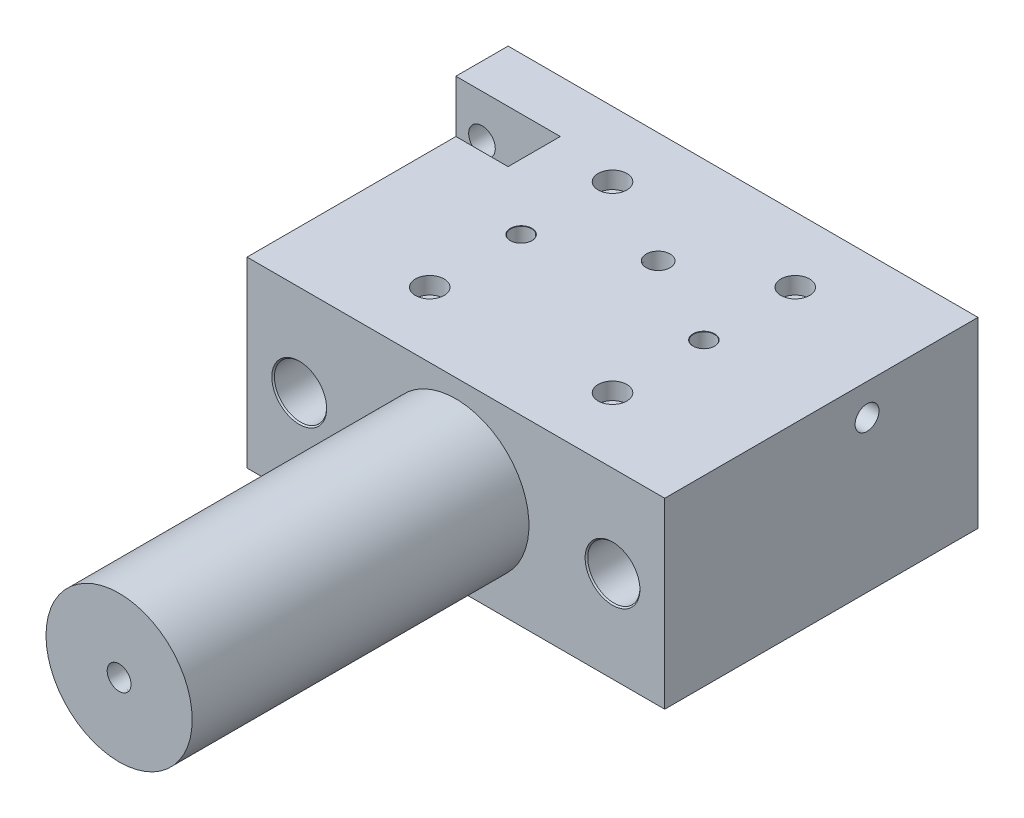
ISO-10303-21;
HEADER;
FILE_DESCRIPTION(('STEP AP214'),'2;1');
FILE_NAME('part.step','',(''),(''),'','','');
FILE_SCHEMA(('AUTOMOTIVE_DESIGN { 1 0 10303 214 1 1 1 1 }'));
ENDSEC;
DATA;
#1=APPLICATION_CONTEXT('core data for automotive mechanical design processes');
#2=APPLICATION_PROTOCOL_DEFINITION('international standard','automotive_design',2000,#1);
#3=PRODUCT_CONTEXT('',#1,'mechanical');
#4=PRODUCT('Part','Part','',(#3));
#5=PRODUCT_RELATED_PRODUCT_CATEGORY('part','',(#4));
#6=PRODUCT_DEFINITION_FORMATION('','',#4);
#7=PRODUCT_DEFINITION_CONTEXT('part definition',#1,'design');
#8=PRODUCT_DEFINITION('design','',#6,#7);
#9=PRODUCT_DEFINITION_SHAPE('','',#8);
#10=(LENGTH_UNIT() NAMED_UNIT(*) SI_UNIT(.MILLI.,.METRE.));
#11=(NAMED_UNIT(*) PLANE_ANGLE_UNIT() SI_UNIT($,.RADIAN.));
#12=(NAMED_UNIT(*) SI_UNIT($,.STERADIAN.) SOLID_ANGLE_UNIT());
#13=UNCERTAINTY_MEASURE_WITH_UNIT(LENGTH_MEASURE(1.E-05),#10,'distance_accuracy_value','');
#14=(GEOMETRIC_REPRESENTATION_CONTEXT(3) GLOBAL_UNCERTAINTY_ASSIGNED_CONTEXT((#13)) GLOBAL_UNIT_ASSIGNED_CONTEXT((#10,
#11,#12)) REPRESENTATION_CONTEXT('',''));
#15=CARTESIAN_POINT('',(0.,0.,0.));
#16=DIRECTION('',(0.,0.,1.));
#17=DIRECTION('',(1.,0.,0.));
#18=AXIS2_PLACEMENT_3D('',#15,#16,#17);
#19=CARTESIAN_POINT('',(0.,4.,-111.));
#20=DIRECTION('',(-1.,0.,0.));
#21=DIRECTION('',(0.,0.,1.));
#22=AXIS2_PLACEMENT_3D('',#19,#20,#21);
#23=CYLINDRICAL_SURFACE('',#22,2.39999999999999);
#24=CARTESIAN_POINT('',(8.99999999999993,4.,-111.));
#25=DIRECTION('',(-1.,0.,0.));
#26=DIRECTION('',(0.,0.,1.));
#27=AXIS2_PLACEMENT_3D('',#24,#25,#26);
#28=CIRCLE('',#27,2.39999999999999);
#29=CARTESIAN_POINT('',(8.99999999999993,4.,-108.6));
#30=VERTEX_POINT('',#29);
#31=EDGE_CURVE('E9355',#30,#30,#28,.T.);
#32=ORIENTED_EDGE('',*,*,#31,.F.);
#33=EDGE_LOOP('',(#32));
#34=FACE_BOUND('',#33,.T.);
#35=CARTESIAN_POINT('',(4.5,4.,-111.));
#36=DIRECTION('',(-1.,0.,0.));
#37=DIRECTION('',(0.,0.,1.));
#38=AXIS2_PLACEMENT_3D('',#35,#36,#37);
#39=CIRCLE('',#38,2.39999999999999);
#40=CARTESIAN_POINT('',(4.5,4.,-108.6));
#41=VERTEX_POINT('',#40);
#42=EDGE_CURVE('E9342',#41,#41,#39,.F.);
#43=ORIENTED_EDGE('',*,*,#42,.F.);
#44=EDGE_LOOP('',(#43));
#45=FACE_BOUND('',#44,.T.);
#46=ADVANCED_FACE('F9174',(#34,#45),#23,.F.);
#47=CARTESIAN_POINT('',(0.,70.,-120.));
#48=DIRECTION('',(1.,0.,0.));
#49=DIRECTION('',(0.,0.,-1.));
#50=AXIS2_PLACEMENT_3D('',#47,#48,#49);
#51=PLANE('',#50);
#52=CARTESIAN_POINT('',(0.,4.,-111.));
#53=DIRECTION('',(-1.,0.,0.));
#54=DIRECTION('',(0.,0.,1.));
#55=AXIS2_PLACEMENT_3D('',#52,#53,#54);
#56=CIRCLE('',#55,4.);
#57=CARTESIAN_POINT('',(0.,3.85832158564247,-107.002509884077));
#58=VERTEX_POINT('',#57);
#59=CARTESIAN_POINT('',(0.,4.,-115.));
#60=VERTEX_POINT('',#59);
#61=EDGE_CURVE('E9321',#58,#60,#56,.T.);
#62=ORIENTED_EDGE('',*,*,#61,.F.);
#63=DIRECTION('',(0.,1.,0.));
#64=VECTOR('',#63,1.);
#65=CARTESIAN_POINT('',(0.,3.85832158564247,-107.002509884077));
#66=LINE('',#65,#64);
#67=CARTESIAN_POINT('',(0.,0.,-107.002509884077));
#68=VERTEX_POINT('',#67);
#69=EDGE_CURVE('E9328',#68,#58,#66,.T.);
#70=ORIENTED_EDGE('',*,*,#69,.F.);
#71=DIRECTION('',(0.,0.,1.));
#72=VECTOR('',#71,1.);
#73=CARTESIAN_POINT('',(0.,0.,-120.));
#74=LINE('',#73,#72);
#75=CARTESIAN_POINT('',(0.,0.,-100.));
#76=VERTEX_POINT('',#75);
#77=EDGE_CURVE('E9548',#68,#76,#74,.T.);
#78=ORIENTED_EDGE('',*,*,#77,.T.);
#79=DIRECTION('',(0.,-1.,0.));
#80=VECTOR('',#79,1.);
#81=CARTESIAN_POINT('',(0.,70.,-100.));
#82=LINE('',#81,#80);
#83=CARTESIAN_POINT('',(0.,70.,-100.));
#84=VERTEX_POINT('',#83);
#85=EDGE_CURVE('E9580',#84,#76,#82,.T.);
#86=ORIENTED_EDGE('',*,*,#85,.F.);
#87=DIRECTION('',(0.,0.,1.));
#88=VECTOR('',#87,1.);
#89=CARTESIAN_POINT('',(0.,70.,-120.));
#90=LINE('',#89,#88);
#91=CARTESIAN_POINT('',(0.,70.,-120.));
#92=VERTEX_POINT('',#91);
#93=EDGE_CURVE('E9565',#92,#84,#90,.T.);
#94=ORIENTED_EDGE('',*,*,#93,.F.);
#95=DIRECTION('',(0.,-1.,0.));
#96=VECTOR('',#95,1.);
#97=CARTESIAN_POINT('',(0.,70.,-120.));
#98=LINE('',#97,#96);
#99=CARTESIAN_POINT('',(0.,0.,-120.));
#100=VERTEX_POINT('',#99);
#101=EDGE_CURVE('E9583',#92,#100,#98,.T.);
#102=ORIENTED_EDGE('',*,*,#101,.T.);
#103=CARTESIAN_POINT('',(0.,0.,-115.));
#104=VERTEX_POINT('',#103);
#105=EDGE_CURVE('E9549',#100,#104,#74,.T.);
#106=ORIENTED_EDGE('',*,*,#105,.T.);
#107=DIRECTION('',(0.,-1.,0.));
#108=VECTOR('',#107,1.);
#109=CARTESIAN_POINT('',(0.,4.,-115.));
#110=LINE('',#109,#108);
#111=EDGE_CURVE('E9326',#60,#104,#110,.T.);
#112=ORIENTED_EDGE('',*,*,#111,.F.);
#113=EDGE_LOOP('',(#62,#70,#78,#86,#94,#102,#106,#112));
#114=FACE_BOUND('',#113,.T.);
#115=ADVANCED_FACE('F9645',(#114),#51,.F.);
#116=CARTESIAN_POINT('',(180.,0.,-120.));
#117=DIRECTION('',(0.,-1.,0.));
#118=DIRECTION('',(0.,0.,-1.));
#119=AXIS2_PLACEMENT_3D('',#116,#117,#118);
#120=PLANE('',#119);
#121=DIRECTION('',(-1.,0.,0.));
#122=VECTOR('',#121,1.);
#123=CARTESIAN_POINT('',(4.5,0.,-107.002509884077));
#124=LINE('',#123,#122);
#125=CARTESIAN_POINT('',(4.5,0.,-107.002509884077));
#126=VERTEX_POINT('',#125);
#127=EDGE_CURVE('E9343',#126,#68,#124,.T.);
#128=ORIENTED_EDGE('',*,*,#127,.F.);
#129=DIRECTION('',(0.,0.,1.));
#130=VECTOR('',#129,1.);
#131=CARTESIAN_POINT('',(4.5,0.,-115.));
#132=LINE('',#131,#130);
#133=CARTESIAN_POINT('',(4.5,0.,-115.));
#134=VERTEX_POINT('',#133);
#135=EDGE_CURVE('E9334',#134,#126,#132,.T.);
#136=ORIENTED_EDGE('',*,*,#135,.F.);
#137=DIRECTION('',(-1.,0.,0.));
#138=VECTOR('',#137,1.);
#139=CARTESIAN_POINT('',(4.5,0.,-115.));
#140=LINE('',#139,#138);
#141=EDGE_CURVE('E9345',#134,#104,#140,.T.);
#142=ORIENTED_EDGE('',*,*,#141,.T.);
#143=ORIENTED_EDGE('',*,*,#105,.F.);
#144=DIRECTION('',(-1.,0.,0.));
#145=VECTOR('',#144,1.);
#146=CARTESIAN_POINT('',(0.,0.,-120.));
#147=LINE('',#146,#145);
#148=CARTESIAN_POINT('',(8.99999999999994,0.,-120.));
#149=VERTEX_POINT('',#148);
#150=EDGE_CURVE('E9544',#149,#100,#147,.T.);
#151=ORIENTED_EDGE('',*,*,#150,.F.);
#152=DIRECTION('',(0.,0.,-1.));
#153=VECTOR('',#152,1.);
#154=CARTESIAN_POINT('',(8.99999999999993,0.,-99.));
#155=LINE('',#154,#153);
#156=CARTESIAN_POINT('',(8.99999999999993,0.,-100.));
#157=VERTEX_POINT('',#156);
#158=EDGE_CURVE('E9358',#157,#149,#155,.T.);
#159=ORIENTED_EDGE('',*,*,#158,.F.);
#160=DIRECTION('',(1.,0.,0.));
#161=VECTOR('',#160,1.);
#162=CARTESIAN_POINT('',(0.,0.,-100.));
#163=LINE('',#162,#161);
#164=EDGE_CURVE('E9553',#76,#157,#163,.T.);
#165=ORIENTED_EDGE('',*,*,#164,.F.);
#166=ORIENTED_EDGE('',*,*,#77,.F.);
#167=EDGE_LOOP('',(#128,#136,#142,#143,#151,#159,#165,#166));
#168=FACE_BOUND('',#167,.T.);
#169=ADVANCED_FACE('F9652',(#168),#120,.T.);
#170=CARTESIAN_POINT('',(20.,70.,0.));
#171=DIRECTION('',(0.,0.,-1.));
#172=DIRECTION('',(-1.,0.,0.));
#173=AXIS2_PLACEMENT_3D('',#170,#171,#172);
#174=PLANE('',#173);
#175=DIRECTION('',(1.,0.,0.));
#176=VECTOR('',#175,1.);
#177=CARTESIAN_POINT('',(20.,0.,0.));
#178=LINE('',#177,#176);
#179=CARTESIAN_POINT('',(20.,0.,0.));
#180=VERTEX_POINT('',#179);
#181=CARTESIAN_POINT('',(180.,0.,0.));
#182=VERTEX_POINT('',#181);
#183=EDGE_CURVE('E9558',#180,#182,#178,.T.);
#184=ORIENTED_EDGE('',*,*,#183,.T.);
#185=DIRECTION('',(0.,-1.,0.));
#186=VECTOR('',#185,1.);
#187=CARTESIAN_POINT('',(180.,70.,0.));
#188=LINE('',#187,#186);
#189=CARTESIAN_POINT('',(180.,70.,0.));
#190=VERTEX_POINT('',#189);
#191=EDGE_CURVE('E9572',#190,#182,#188,.T.);
#192=ORIENTED_EDGE('',*,*,#191,.F.);
#193=DIRECTION('',(1.,0.,0.));
#194=VECTOR('',#193,1.);
#195=CARTESIAN_POINT('',(20.,70.,0.));
#196=LINE('',#195,#194);
#197=CARTESIAN_POINT('',(20.,70.,0.));
#198=VERTEX_POINT('',#197);
#199=EDGE_CURVE('E9570',#198,#190,#196,.T.);
#200=ORIENTED_EDGE('',*,*,#199,.F.);
#201=DIRECTION('',(0.,-1.,0.));
#202=VECTOR('',#201,1.);
#203=CARTESIAN_POINT('',(20.,70.,0.));
#204=LINE('',#203,#202);
#205=EDGE_CURVE('E9575',#198,#180,#204,.T.);
#206=ORIENTED_EDGE('',*,*,#205,.T.);
#207=EDGE_LOOP('',(#184,#192,#200,#206));
#208=FACE_BOUND('',#207,.T.);
#209=CARTESIAN_POINT('',(40.,35.,0.));
#210=DIRECTION('',(0.,0.,1.));
#211=DIRECTION('',(1.,0.,0.));
#212=AXIS2_PLACEMENT_3D('',#209,#210,#211);
#213=CIRCLE('',#212,10.5);
#214=CARTESIAN_POINT('',(50.5,35.,0.));
#215=VERTEX_POINT('',#214);
#216=EDGE_CURVE('E9526',#215,#215,#213,.T.);
#217=ORIENTED_EDGE('',*,*,#216,.F.);
#218=EDGE_LOOP('',(#217));
#219=FACE_BOUND('',#218,.T.);
#220=CARTESIAN_POINT('',(160.,35.,0.));
#221=DIRECTION('',(0.,0.,1.));
#222=DIRECTION('',(1.,0.,0.));
#223=AXIS2_PLACEMENT_3D('',#220,#221,#222);
#224=CIRCLE('',#223,10.5);
#225=CARTESIAN_POINT('',(170.5,35.,0.));
#226=VERTEX_POINT('',#225);
#227=EDGE_CURVE('E9514',#226,#226,#224,.T.);
#228=ORIENTED_EDGE('',*,*,#227,.F.);
#229=EDGE_LOOP('',(#228));
#230=FACE_BOUND('',#229,.T.);
#231=CARTESIAN_POINT('',(100.,35.,0.));
#232=DIRECTION('',(0.,0.,-1.));
#233=DIRECTION('',(-1.,0.,0.));
#234=AXIS2_PLACEMENT_3D('',#231,#232,#233);
#235=CIRCLE('',#234,28.);
#236=CARTESIAN_POINT('',(72.,35.,0.));
#237=VERTEX_POINT('',#236);
#238=EDGE_CURVE('E9589',#237,#237,#235,.F.);
#239=ORIENTED_EDGE('',*,*,#238,.F.);
#240=EDGE_LOOP('',(#239));
#241=FACE_BOUND('',#240,.T.);
#242=ADVANCED_FACE('F9626',(#208,#219,#230,#241),#174,.F.);
#243=DIRECTION('',(0.,0.,1.));
#244=VECTOR('',#243,1.);
#245=CARTESIAN_POINT('',(10.9999999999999,0.,-99.));
#246=LINE('',#245,#244);
#247=CARTESIAN_POINT('',(10.9999999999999,0.,-120.));
#248=VERTEX_POINT('',#247);
#249=CARTESIAN_POINT('',(10.9999999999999,0.,-100.));
#250=VERTEX_POINT('',#249);
#251=EDGE_CURVE('E9360',#248,#250,#246,.T.);
#252=ORIENTED_EDGE('',*,*,#251,.F.);
#253=CARTESIAN_POINT('',(180.,0.,-120.));
#254=VERTEX_POINT('',#253);
#255=EDGE_CURVE('E9545',#254,#248,#147,.T.);
#256=ORIENTED_EDGE('',*,*,#255,.F.);
#257=DIRECTION('',(0.,0.,-1.));
#258=VECTOR('',#257,1.);
#259=CARTESIAN_POINT('',(180.,0.,0.));
#260=LINE('',#259,#258);
#261=EDGE_CURVE('E9541',#182,#254,#260,.T.);
#262=ORIENTED_EDGE('',*,*,#261,.F.);
#263=ORIENTED_EDGE('',*,*,#183,.F.);
#264=DIRECTION('',(0.,0.,1.));
#265=VECTOR('',#264,1.);
#266=CARTESIAN_POINT('',(19.9999999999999,0.,-100.));
#267=LINE('',#266,#265);
#268=CARTESIAN_POINT('',(19.9999999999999,0.,-100.));
#269=VERTEX_POINT('',#268);
#270=EDGE_CURVE('E9556',#269,#180,#267,.T.);
#271=ORIENTED_EDGE('',*,*,#270,.F.);
#272=EDGE_CURVE('E9552',#250,#269,#163,.T.);
#273=ORIENTED_EDGE('',*,*,#272,.F.);
#274=EDGE_LOOP('',(#252,#256,#262,#263,#271,#273));
#275=FACE_BOUND('',#274,.T.);
#276=CARTESIAN_POINT('',(100.,0.,-77.5));
#277=DIRECTION('',(0.,-1.,0.));
#278=DIRECTION('',(0.,0.,-1.));
#279=AXIS2_PLACEMENT_3D('',#276,#277,#278);
#280=CIRCLE('',#279,4.57349999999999);
#281=CARTESIAN_POINT('',(100.,0.,-82.0735));
#282=VERTEX_POINT('',#281);
#283=EDGE_CURVE('E9422',#282,#282,#280,.T.);
#284=ORIENTED_EDGE('',*,*,#283,.F.);
#285=EDGE_LOOP('',(#284));
#286=FACE_BOUND('',#285,.T.);
#287=CARTESIAN_POINT('',(65.,0.,-25.));
#288=DIRECTION('',(0.,-1.,0.));
#289=DIRECTION('',(0.,0.,-1.));
#290=AXIS2_PLACEMENT_3D('',#287,#288,#289);
#291=CIRCLE('',#290,5.50000000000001);
#292=CARTESIAN_POINT('',(65.,0.,-30.5));
#293=VERTEX_POINT('',#292);
#294=EDGE_CURVE('E9428',#293,#293,#291,.T.);
#295=ORIENTED_EDGE('',*,*,#294,.F.);
#296=EDGE_LOOP('',(#295));
#297=FACE_BOUND('',#296,.T.);
#298=CARTESIAN_POINT('',(65.,0.,-95.));
#299=DIRECTION('',(0.,-1.,0.));
#300=DIRECTION('',(0.,0.,-1.));
#301=AXIS2_PLACEMENT_3D('',#298,#299,#300);
#302=CIRCLE('',#301,5.50000000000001);
#303=CARTESIAN_POINT('',(65.,0.,-100.5));
#304=VERTEX_POINT('',#303);
#305=EDGE_CURVE('E9456',#304,#304,#302,.T.);
#306=ORIENTED_EDGE('',*,*,#305,.F.);
#307=EDGE_LOOP('',(#306));
#308=FACE_BOUND('',#307,.T.);
#309=CARTESIAN_POINT('',(135.,0.,-60.));
#310=DIRECTION('',(0.,-1.,0.));
#311=DIRECTION('',(0.,0.,-1.));
#312=AXIS2_PLACEMENT_3D('',#309,#310,#311);
#313=CIRCLE('',#312,4.12499999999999);
#314=CARTESIAN_POINT('',(135.,0.,-64.125));
#315=VERTEX_POINT('',#314);
#316=EDGE_CURVE('E9490',#315,#315,#313,.T.);
#317=ORIENTED_EDGE('',*,*,#316,.F.);
#318=EDGE_LOOP('',(#317));
#319=FACE_BOUND('',#318,.T.);
#320=CARTESIAN_POINT('',(65.,0.,-60.));
#321=DIRECTION('',(0.,-1.,0.));
#322=DIRECTION('',(0.,0.,-1.));
#323=AXIS2_PLACEMENT_3D('',#320,#321,#322);
#324=CIRCLE('',#323,4.125);
#325=CARTESIAN_POINT('',(65.,0.,-64.125));
#326=VERTEX_POINT('',#325);
#327=EDGE_CURVE('E9502',#326,#326,#324,.T.);
#328=ORIENTED_EDGE('',*,*,#327,.F.);
#329=EDGE_LOOP('',(#328));
#330=FACE_BOUND('',#329,.T.);
#331=CARTESIAN_POINT('',(135.,0.,-95.));
#332=DIRECTION('',(0.,-1.,0.));
#333=DIRECTION('',(0.,0.,-1.));
#334=AXIS2_PLACEMENT_3D('',#331,#332,#333);
#335=CIRCLE('',#334,5.50000000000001);
#336=CARTESIAN_POINT('',(135.,0.,-100.5));
#337=VERTEX_POINT('',#336);
#338=EDGE_CURVE('E9470',#337,#337,#335,.T.);
#339=ORIENTED_EDGE('',*,*,#338,.F.);
#340=EDGE_LOOP('',(#339));
#341=FACE_BOUND('',#340,.T.);
#342=CARTESIAN_POINT('',(135.,0.,-25.));
#343=DIRECTION('',(0.,-1.,0.));
#344=DIRECTION('',(0.,0.,-1.));
#345=AXIS2_PLACEMENT_3D('',#342,#343,#344);
#346=CIRCLE('',#345,5.50000000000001);
#347=CARTESIAN_POINT('',(135.,0.,-30.5));
#348=VERTEX_POINT('',#347);
#349=EDGE_CURVE('E9442',#348,#348,#346,.T.);
#350=ORIENTED_EDGE('',*,*,#349,.F.);
#351=EDGE_LOOP('',(#350));
#352=FACE_BOUND('',#351,.T.);
#353=ADVANCED_FACE('F9631',(#275,#286,#297,#308,#319,#330,#341,#352),#120,.T.);
#354=CARTESIAN_POINT('',(180.,70.,0.));
#355=DIRECTION('',(-1.,0.,0.));
#356=DIRECTION('',(0.,0.,1.));
#357=AXIS2_PLACEMENT_3D('',#354,#355,#356);
#358=PLANE('',#357);
#359=CARTESIAN_POINT('',(180.,58.,-77.5));
#360=DIRECTION('',(1.,0.,0.));
#361=DIRECTION('',(0.,0.,-1.));
#362=AXIS2_PLACEMENT_3D('',#359,#360,#361);
#363=CIRCLE('',#362,4.57349999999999);
#364=CARTESIAN_POINT('',(180.,58.,-82.0735));
#365=VERTEX_POINT('',#364);
#366=EDGE_CURVE('E9398',#365,#365,#363,.T.);
#367=ORIENTED_EDGE('',*,*,#366,.F.);
#368=EDGE_LOOP('',(#367));
#369=FACE_BOUND('',#368,.T.);
#370=ORIENTED_EDGE('',*,*,#261,.T.);
#371=DIRECTION('',(0.,-1.,0.));
#372=VECTOR('',#371,1.);
#373=CARTESIAN_POINT('',(180.,70.,-120.));
#374=LINE('',#373,#372);
#375=CARTESIAN_POINT('',(180.,70.,-120.));
#376=VERTEX_POINT('',#375);
#377=EDGE_CURVE('E9586',#376,#254,#374,.T.);
#378=ORIENTED_EDGE('',*,*,#377,.F.);
#379=DIRECTION('',(0.,0.,-1.));
#380=VECTOR('',#379,1.);
#381=CARTESIAN_POINT('',(180.,70.,0.));
#382=LINE('',#381,#380);
#383=EDGE_CURVE('E9560',#190,#376,#382,.T.);
#384=ORIENTED_EDGE('',*,*,#383,.F.);
#385=ORIENTED_EDGE('',*,*,#191,.T.);
#386=EDGE_LOOP('',(#370,#378,#384,#385));
#387=FACE_BOUND('',#386,.T.);
#388=ADVANCED_FACE('F9176',(#369,#387),#358,.F.);
#389=CARTESIAN_POINT('',(0.,70.,-120.));
#390=DIRECTION('',(0.,0.,1.));
#391=DIRECTION('',(1.,0.,0.));
#392=AXIS2_PLACEMENT_3D('',#389,#390,#391);
#393=PLANE('',#392);
#394=CARTESIAN_POINT('',(160.,35.,-120.));
#395=DIRECTION('',(0.,0.,1.));
#396=DIRECTION('',(1.,0.,0.));
#397=AXIS2_PLACEMENT_3D('',#394,#395,#396);
#398=CIRCLE('',#397,10.5);
#399=CARTESIAN_POINT('',(170.5,35.,-120.));
#400=VERTEX_POINT('',#399);
#401=EDGE_CURVE('E9505',#400,#400,#398,.T.);
#402=ORIENTED_EDGE('',*,*,#401,.T.);
#403=EDGE_LOOP('',(#402));
#404=FACE_BOUND('',#403,.T.);
#405=CARTESIAN_POINT('',(40.,35.,-120.));
#406=DIRECTION('',(0.,0.,1.));
#407=DIRECTION('',(1.,0.,0.));
#408=AXIS2_PLACEMENT_3D('',#405,#406,#407);
#409=CIRCLE('',#408,10.5);
#410=CARTESIAN_POINT('',(50.5,35.,-120.));
#411=VERTEX_POINT('',#410);
#412=EDGE_CURVE('E9517',#411,#411,#409,.T.);
#413=ORIENTED_EDGE('',*,*,#412,.T.);
#414=EDGE_LOOP('',(#413));
#415=FACE_BOUND('',#414,.T.);
#416=CARTESIAN_POINT('',(9.99999999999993,53.5,-120.));
#417=DIRECTION('',(0.,0.,1.));
#418=DIRECTION('',(1.,0.,0.));
#419=AXIS2_PLACEMENT_3D('',#416,#417,#418);
#420=CIRCLE('',#419,5.1);
#421=CARTESIAN_POINT('',(15.0999999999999,53.5,-120.));
#422=VERTEX_POINT('',#421);
#423=EDGE_CURVE('E9529',#422,#422,#420,.T.);
#424=ORIENTED_EDGE('',*,*,#423,.T.);
#425=EDGE_LOOP('',(#424));
#426=FACE_BOUND('',#425,.T.);
#427=CARTESIAN_POINT('',(9.99999999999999,13.5,-120.));
#428=DIRECTION('',(0.,0.,1.));
#429=DIRECTION('',(1.,0.,0.));
#430=AXIS2_PLACEMENT_3D('',#427,#428,#429);
#431=CIRCLE('',#430,6.);
#432=CARTESIAN_POINT('',(10.9999999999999,7.58392021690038,-120.));
#433=VERTEX_POINT('',#432);
#434=CARTESIAN_POINT('',(8.99999999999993,7.5839202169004,-120.));
#435=VERTEX_POINT('',#434);
#436=EDGE_CURVE('E9535',#433,#435,#431,.T.);
#437=ORIENTED_EDGE('',*,*,#436,.T.);
#438=DIRECTION('',(0.,-1.,0.));
#439=VECTOR('',#438,1.);
#440=CARTESIAN_POINT('',(8.99999999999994,70.,-120.));
#441=LINE('',#440,#439);
#442=EDGE_CURVE('E9371',#435,#149,#441,.T.);
#443=ORIENTED_EDGE('',*,*,#442,.T.);
#444=ORIENTED_EDGE('',*,*,#150,.T.);
#445=ORIENTED_EDGE('',*,*,#101,.F.);
#446=DIRECTION('',(-1.,0.,0.));
#447=VECTOR('',#446,1.);
#448=CARTESIAN_POINT('',(0.,70.,-120.));
#449=LINE('',#448,#447);
#450=EDGE_CURVE('E9563',#376,#92,#449,.T.);
#451=ORIENTED_EDGE('',*,*,#450,.F.);
#452=ORIENTED_EDGE('',*,*,#377,.T.);
#453=ORIENTED_EDGE('',*,*,#255,.T.);
#454=DIRECTION('',(0.,1.,0.));
#455=VECTOR('',#454,1.);
#456=CARTESIAN_POINT('',(10.9999999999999,70.,-120.));
#457=LINE('',#456,#455);
#458=EDGE_CURVE('E9365',#248,#433,#457,.T.);
#459=ORIENTED_EDGE('',*,*,#458,.T.);
#460=EDGE_LOOP('',(#437,#443,#444,#445,#451,#452,#453,#459));
#461=FACE_BOUND('',#460,.T.);
#462=ADVANCED_FACE('F9640',(#404,#415,#426,#461),#393,.F.);
#463=CARTESIAN_POINT('',(0.,70.,-100.));
#464=DIRECTION('',(0.,0.,-1.));
#465=DIRECTION('',(-1.,0.,0.));
#466=AXIS2_PLACEMENT_3D('',#463,#464,#465);
#467=PLANE('',#466);
#468=CARTESIAN_POINT('',(9.99999999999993,53.5,-100.));
#469=DIRECTION('',(0.,0.,1.));
#470=DIRECTION('',(1.,0.,0.));
#471=AXIS2_PLACEMENT_3D('',#468,#469,#470);
#472=CIRCLE('',#471,5.1);
#473=CARTESIAN_POINT('',(15.0999999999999,53.5,-100.));
#474=VERTEX_POINT('',#473);
#475=EDGE_CURVE('E9532',#474,#474,#472,.T.);
#476=ORIENTED_EDGE('',*,*,#475,.F.);
#477=EDGE_LOOP('',(#476));
#478=FACE_BOUND('',#477,.T.);
#479=DIRECTION('',(0.,-1.,0.));
#480=VECTOR('',#479,1.);
#481=CARTESIAN_POINT('',(19.9999999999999,70.,-100.));
#482=LINE('',#481,#480);
#483=CARTESIAN_POINT('',(19.9999999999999,50.,-100.));
#484=VERTEX_POINT('',#483);
#485=EDGE_CURVE('E9578',#484,#269,#482,.T.);
#486=ORIENTED_EDGE('',*,*,#485,.F.);
#487=DIRECTION('',(-0.707106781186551,-0.707106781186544,0.));
#488=VECTOR('',#487,1.);
#489=CARTESIAN_POINT('',(19.9999999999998,50.,-100.));
#490=LINE('',#489,#488);
#491=CARTESIAN_POINT('',(39.9999999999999,70.,-100.));
#492=VERTEX_POINT('',#491);
#493=EDGE_CURVE('E9182',#484,#492,#490,.F.);
#494=ORIENTED_EDGE('',*,*,#493,.T.);
#495=DIRECTION('',(1.,0.,0.));
#496=VECTOR('',#495,1.);
#497=CARTESIAN_POINT('',(0.,70.,-100.));
#498=LINE('',#497,#496);
#499=EDGE_CURVE('E9311',#84,#492,#498,.T.);
#500=ORIENTED_EDGE('',*,*,#499,.F.);
#501=ORIENTED_EDGE('',*,*,#85,.T.);
#502=ORIENTED_EDGE('',*,*,#164,.T.);
#503=DIRECTION('',(0.,1.,0.));
#504=VECTOR('',#503,1.);
#505=CARTESIAN_POINT('',(8.99999999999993,70.,-100.));
#506=LINE('',#505,#504);
#507=CARTESIAN_POINT('',(8.99999999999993,7.58392021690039,-100.));
#508=VERTEX_POINT('',#507);
#509=EDGE_CURVE('E9368',#157,#508,#506,.T.);
#510=ORIENTED_EDGE('',*,*,#509,.T.);
#511=CARTESIAN_POINT('',(9.99999999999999,13.5,-100.));
#512=DIRECTION('',(0.,0.,1.));
#513=DIRECTION('',(1.,0.,0.));
#514=AXIS2_PLACEMENT_3D('',#511,#512,#513);
#515=CIRCLE('',#514,6.);
#516=CARTESIAN_POINT('',(10.9999999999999,7.58392021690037,-100.));
#517=VERTEX_POINT('',#516);
#518=EDGE_CURVE('E9538',#517,#508,#515,.T.);
#519=ORIENTED_EDGE('',*,*,#518,.F.);
#520=DIRECTION('',(0.,-1.,0.));
#521=VECTOR('',#520,1.);
#522=CARTESIAN_POINT('',(10.9999999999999,70.,-100.));
#523=LINE('',#522,#521);
#524=EDGE_CURVE('E9362',#517,#250,#523,.T.);
#525=ORIENTED_EDGE('',*,*,#524,.T.);
#526=ORIENTED_EDGE('',*,*,#272,.T.);
#527=EDGE_LOOP('',(#486,#494,#500,#501,#502,#510,#519,#525,#526));
#528=FACE_BOUND('',#527,.T.);
#529=ADVANCED_FACE('F9616',(#478,#528),#467,.F.);
#530=CARTESIAN_POINT('',(19.9999999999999,70.,-100.));
#531=DIRECTION('',(1.,0.,0.));
#532=DIRECTION('',(0.,0.,-1.));
#533=AXIS2_PLACEMENT_3D('',#530,#531,#532);
#534=PLANE('',#533);
#535=DIRECTION('',(0.,0.,1.));
#536=VECTOR('',#535,1.);
#537=CARTESIAN_POINT('',(19.9999999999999,70.,-100.));
#538=LINE('',#537,#536);
#539=CARTESIAN_POINT('',(19.9999999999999,70.,-80.));
#540=VERTEX_POINT('',#539);
#541=EDGE_CURVE('E9568',#540,#198,#538,.T.);
#542=ORIENTED_EDGE('',*,*,#541,.F.);
#543=DIRECTION('',(0.,1.,0.));
#544=VECTOR('',#543,1.);
#545=CARTESIAN_POINT('',(19.9999999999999,50.,-80.));
#546=LINE('',#545,#544);
#547=CARTESIAN_POINT('',(19.9999999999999,50.,-80.));
#548=VERTEX_POINT('',#547);
#549=EDGE_CURVE('E9188',#548,#540,#546,.T.);
#550=ORIENTED_EDGE('',*,*,#549,.F.);
#551=DIRECTION('',(0.,0.,1.));
#552=VECTOR('',#551,1.);
#553=CARTESIAN_POINT('',(19.9999999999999,50.,-80.));
#554=LINE('',#553,#552);
#555=EDGE_CURVE('E9313',#484,#548,#554,.T.);
#556=ORIENTED_EDGE('',*,*,#555,.F.);
#557=ORIENTED_EDGE('',*,*,#485,.T.);
#558=ORIENTED_EDGE('',*,*,#270,.T.);
#559=ORIENTED_EDGE('',*,*,#205,.F.);
#560=EDGE_LOOP('',(#542,#550,#556,#557,#558,#559));
#561=FACE_BOUND('',#560,.T.);
#562=ADVANCED_FACE('F9620',(#561),#534,.F.);
#563=CARTESIAN_POINT('',(180.,70.,-120.));
#564=DIRECTION('',(0.,-1.,0.));
#565=DIRECTION('',(0.,0.,-1.));
#566=AXIS2_PLACEMENT_3D('',#563,#564,#565);
#567=PLANE('',#566);
#568=CARTESIAN_POINT('',(100.,70.,-77.5));
#569=DIRECTION('',(0.,1.,0.));
#570=DIRECTION('',(0.,0.,1.));
#571=AXIS2_PLACEMENT_3D('',#568,#569,#570);
#572=CIRCLE('',#571,4.57349999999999);
#573=CARTESIAN_POINT('',(100.,70.,-72.9265));
#574=VERTEX_POINT('',#573);
#575=EDGE_CURVE('E9401',#574,#574,#572,.T.);
#576=ORIENTED_EDGE('',*,*,#575,.F.);
#577=EDGE_LOOP('',(#576));
#578=FACE_BOUND('',#577,.T.);
#579=CARTESIAN_POINT('',(65.,70.,-25.));
#580=DIRECTION('',(0.,1.,0.));
#581=DIRECTION('',(0.,0.,1.));
#582=AXIS2_PLACEMENT_3D('',#579,#580,#581);
#583=CIRCLE('',#582,5.50000000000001);
#584=CARTESIAN_POINT('',(65.,70.,-19.5));
#585=VERTEX_POINT('',#584);
#586=EDGE_CURVE('E9435',#585,#585,#583,.T.);
#587=ORIENTED_EDGE('',*,*,#586,.F.);
#588=EDGE_LOOP('',(#587));
#589=FACE_BOUND('',#588,.T.);
#590=CARTESIAN_POINT('',(135.,70.,-25.));
#591=DIRECTION('',(0.,1.,0.));
#592=DIRECTION('',(0.,0.,1.));
#593=AXIS2_PLACEMENT_3D('',#590,#591,#592);
#594=CIRCLE('',#593,5.50000000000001);
#595=CARTESIAN_POINT('',(135.,70.,-19.5));
#596=VERTEX_POINT('',#595);
#597=EDGE_CURVE('E9449',#596,#596,#594,.T.);
#598=ORIENTED_EDGE('',*,*,#597,.F.);
#599=EDGE_LOOP('',(#598));
#600=FACE_BOUND('',#599,.T.);
#601=CARTESIAN_POINT('',(65.,70.,-95.));
#602=DIRECTION('',(0.,1.,0.));
#603=DIRECTION('',(0.,0.,1.));
#604=AXIS2_PLACEMENT_3D('',#601,#602,#603);
#605=CIRCLE('',#604,5.50000000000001);
#606=CARTESIAN_POINT('',(65.,70.,-89.5));
#607=VERTEX_POINT('',#606);
#608=EDGE_CURVE('E9463',#607,#607,#605,.T.);
#609=ORIENTED_EDGE('',*,*,#608,.F.);
#610=EDGE_LOOP('',(#609));
#611=FACE_BOUND('',#610,.T.);
#612=CARTESIAN_POINT('',(135.,70.,-95.));
#613=DIRECTION('',(0.,1.,0.));
#614=DIRECTION('',(0.,0.,1.));
#615=AXIS2_PLACEMENT_3D('',#612,#613,#614);
#616=CIRCLE('',#615,5.50000000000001);
#617=CARTESIAN_POINT('',(135.,70.,-89.5));
#618=VERTEX_POINT('',#617);
#619=EDGE_CURVE('E9477',#618,#618,#616,.T.);
#620=ORIENTED_EDGE('',*,*,#619,.F.);
#621=EDGE_LOOP('',(#620));
#622=FACE_BOUND('',#621,.T.);
#623=CARTESIAN_POINT('',(135.,70.,-60.));
#624=DIRECTION('',(0.,-1.,0.));
#625=DIRECTION('',(0.,0.,-1.));
#626=AXIS2_PLACEMENT_3D('',#623,#624,#625);
#627=CIRCLE('',#626,4.12499999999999);
#628=CARTESIAN_POINT('',(135.,70.,-64.125));
#629=VERTEX_POINT('',#628);
#630=EDGE_CURVE('E9481',#629,#629,#627,.T.);
#631=ORIENTED_EDGE('',*,*,#630,.T.);
#632=EDGE_LOOP('',(#631));
#633=FACE_BOUND('',#632,.T.);
#634=CARTESIAN_POINT('',(65.,70.,-60.));
#635=DIRECTION('',(0.,-1.,0.));
#636=DIRECTION('',(0.,0.,-1.));
#637=AXIS2_PLACEMENT_3D('',#634,#635,#636);
#638=CIRCLE('',#637,4.12499999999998);
#639=CARTESIAN_POINT('',(65.,70.,-64.125));
#640=VERTEX_POINT('',#639);
#641=EDGE_CURVE('E9493',#640,#640,#638,.T.);
#642=ORIENTED_EDGE('',*,*,#641,.T.);
#643=EDGE_LOOP('',(#642));
#644=FACE_BOUND('',#643,.T.);
#645=ORIENTED_EDGE('',*,*,#499,.T.);
#646=DIRECTION('',(0.,0.,-1.));
#647=VECTOR('',#646,1.);
#648=CARTESIAN_POINT('',(39.9999999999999,70.,-100.));
#649=LINE('',#648,#647);
#650=CARTESIAN_POINT('',(39.9999999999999,70.,-80.));
#651=VERTEX_POINT('',#650);
#652=EDGE_CURVE('E9305',#651,#492,#649,.T.);
#653=ORIENTED_EDGE('',*,*,#652,.F.);
#654=DIRECTION('',(1.,0.,0.));
#655=VECTOR('',#654,1.);
#656=CARTESIAN_POINT('',(39.9999999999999,70.,-80.));
#657=LINE('',#656,#655);
#658=EDGE_CURVE('E9299',#540,#651,#657,.T.);
#659=ORIENTED_EDGE('',*,*,#658,.F.);
#660=ORIENTED_EDGE('',*,*,#541,.T.);
#661=ORIENTED_EDGE('',*,*,#199,.T.);
#662=ORIENTED_EDGE('',*,*,#383,.T.);
#663=ORIENTED_EDGE('',*,*,#450,.T.);
#664=ORIENTED_EDGE('',*,*,#93,.T.);
#665=EDGE_LOOP('',(#645,#653,#659,#660,#661,#662,#663,#664));
#666=FACE_BOUND('',#665,.T.);
#667=ADVANCED_FACE('F9309',(#578,#589,#600,#611,#622,#633,#644,#666),#567,.F.);
#668=CARTESIAN_POINT('',(9.99999999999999,13.5,-100.));
#669=DIRECTION('',(0.,0.,1.));
#670=DIRECTION('',(1.,0.,0.));
#671=AXIS2_PLACEMENT_3D('',#668,#669,#670);
#672=CYLINDRICAL_SURFACE('',#671,6.);
#673=ORIENTED_EDGE('',*,*,#518,.T.);
#674=DIRECTION('',(0.,0.,1.));
#675=VECTOR('',#674,1.);
#676=CARTESIAN_POINT('',(8.99999999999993,7.58392021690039,-100.));
#677=LINE('',#676,#675);
#678=EDGE_CURVE('E9611',#508,#435,#677,.F.);
#679=ORIENTED_EDGE('',*,*,#678,.T.);
#680=ORIENTED_EDGE('',*,*,#436,.F.);
#681=DIRECTION('',(0.,0.,1.));
#682=VECTOR('',#681,1.);
#683=CARTESIAN_POINT('',(10.9999999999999,7.58392021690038,-100.));
#684=LINE('',#683,#682);
#685=EDGE_CURVE('E9608',#433,#517,#684,.T.);
#686=ORIENTED_EDGE('',*,*,#685,.T.);
#687=EDGE_LOOP('',(#673,#679,#680,#686));
#688=FACE_BOUND('',#687,.T.);
#689=ADVANCED_FACE('F9657',(#688),#672,.F.);
#690=CARTESIAN_POINT('',(9.99999999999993,53.5,-100.));
#691=DIRECTION('',(0.,0.,1.));
#692=DIRECTION('',(1.,0.,0.));
#693=AXIS2_PLACEMENT_3D('',#690,#691,#692);
#694=CYLINDRICAL_SURFACE('',#693,5.1);
#695=ORIENTED_EDGE('',*,*,#423,.F.);
#696=EDGE_LOOP('',(#695));
#697=FACE_BOUND('',#696,.T.);
#698=ORIENTED_EDGE('',*,*,#475,.T.);
#699=EDGE_LOOP('',(#698));
#700=FACE_BOUND('',#699,.T.);
#701=ADVANCED_FACE('F9789',(#697,#700),#694,.F.);
#702=CARTESIAN_POINT('',(40.,35.,0.));
#703=DIRECTION('',(0.,0.,1.));
#704=DIRECTION('',(1.,0.,0.));
#705=AXIS2_PLACEMENT_3D('',#702,#703,#704);
#706=CONICAL_SURFACE('',#705,10.5,0.785398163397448);
#707=CARTESIAN_POINT('',(40.,35.,-0.500000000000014));
#708=DIRECTION('',(0.,0.,1.));
#709=DIRECTION('',(1.,0.,0.));
#710=AXIS2_PLACEMENT_3D('',#707,#708,#709);
#711=CIRCLE('',#710,9.99999999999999);
#712=CARTESIAN_POINT('',(50.,35.,-0.500000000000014));
#713=VERTEX_POINT('',#712);
#714=EDGE_CURVE('E9523',#713,#713,#711,.T.);
#715=ORIENTED_EDGE('',*,*,#714,.F.);
#716=EDGE_LOOP('',(#715));
#717=FACE_BOUND('',#716,.T.);
#718=ORIENTED_EDGE('',*,*,#216,.T.);
#719=EDGE_LOOP('',(#718));
#720=FACE_BOUND('',#719,.T.);
#721=ADVANCED_FACE('F10199',(#717,#720),#706,.F.);
#722=CARTESIAN_POINT('',(40.,35.,0.));
#723=DIRECTION('',(0.,0.,1.));
#724=DIRECTION('',(1.,0.,0.));
#725=AXIS2_PLACEMENT_3D('',#722,#723,#724);
#726=CYLINDRICAL_SURFACE('',#725,9.99999999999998);
#727=CARTESIAN_POINT('',(40.,35.,-119.5));
#728=DIRECTION('',(0.,0.,1.));
#729=DIRECTION('',(1.,0.,0.));
#730=AXIS2_PLACEMENT_3D('',#727,#728,#729);
#731=CIRCLE('',#730,9.99999999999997);
#732=CARTESIAN_POINT('',(50.,35.,-119.5));
#733=VERTEX_POINT('',#732);
#734=EDGE_CURVE('E9520',#733,#733,#731,.T.);
#735=ORIENTED_EDGE('',*,*,#734,.F.);
#736=EDGE_LOOP('',(#735));
#737=FACE_BOUND('',#736,.T.);
#738=ORIENTED_EDGE('',*,*,#714,.T.);
#739=EDGE_LOOP('',(#738));
#740=FACE_BOUND('',#739,.T.);
#741=ADVANCED_FACE('F10191',(#737,#740),#726,.F.);
#742=CARTESIAN_POINT('',(40.,35.,-119.5));
#743=DIRECTION('',(0.,0.,-1.));
#744=DIRECTION('',(-1.,0.,0.));
#745=AXIS2_PLACEMENT_3D('',#742,#743,#744);
#746=CONICAL_SURFACE('',#745,9.99999999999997,0.785398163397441);
#747=ORIENTED_EDGE('',*,*,#412,.F.);
#748=EDGE_LOOP('',(#747));
#749=FACE_BOUND('',#748,.T.);
#750=ORIENTED_EDGE('',*,*,#734,.T.);
#751=EDGE_LOOP('',(#750));
#752=FACE_BOUND('',#751,.T.);
#753=ADVANCED_FACE('F10183',(#749,#752),#746,.F.);
#754=CARTESIAN_POINT('',(160.,35.,0.));
#755=DIRECTION('',(0.,0.,1.));
#756=DIRECTION('',(1.,0.,0.));
#757=AXIS2_PLACEMENT_3D('',#754,#755,#756);
#758=CONICAL_SURFACE('',#757,10.5,0.785398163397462);
#759=CARTESIAN_POINT('',(160.,35.,-0.500000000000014));
#760=DIRECTION('',(0.,0.,1.));
#761=DIRECTION('',(1.,0.,0.));
#762=AXIS2_PLACEMENT_3D('',#759,#760,#761);
#763=CIRCLE('',#762,9.99999999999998);
#764=CARTESIAN_POINT('',(170.,35.,-0.500000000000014));
#765=VERTEX_POINT('',#764);
#766=EDGE_CURVE('E9511',#765,#765,#763,.T.);
#767=ORIENTED_EDGE('',*,*,#766,.F.);
#768=EDGE_LOOP('',(#767));
#769=FACE_BOUND('',#768,.T.);
#770=ORIENTED_EDGE('',*,*,#227,.T.);
#771=EDGE_LOOP('',(#770));
#772=FACE_BOUND('',#771,.T.);
#773=ADVANCED_FACE('F10175',(#769,#772),#758,.F.);
#774=CARTESIAN_POINT('',(160.,35.,0.));
#775=DIRECTION('',(0.,0.,1.));
#776=DIRECTION('',(1.,0.,0.));
#777=AXIS2_PLACEMENT_3D('',#774,#775,#776);
#778=CYLINDRICAL_SURFACE('',#777,9.99999999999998);
#779=CARTESIAN_POINT('',(160.,35.,-119.5));
#780=DIRECTION('',(0.,0.,1.));
#781=DIRECTION('',(1.,0.,0.));
#782=AXIS2_PLACEMENT_3D('',#779,#780,#781);
#783=CIRCLE('',#782,9.99999999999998);
#784=CARTESIAN_POINT('',(170.,35.,-119.5));
#785=VERTEX_POINT('',#784);
#786=EDGE_CURVE('E9508',#785,#785,#783,.T.);
#787=ORIENTED_EDGE('',*,*,#786,.F.);
#788=EDGE_LOOP('',(#787));
#789=FACE_BOUND('',#788,.T.);
#790=ORIENTED_EDGE('',*,*,#766,.T.);
#791=EDGE_LOOP('',(#790));
#792=FACE_BOUND('',#791,.T.);
#793=ADVANCED_FACE('F10167',(#789,#792),#778,.F.);
#794=CARTESIAN_POINT('',(160.,35.,-119.5));
#795=DIRECTION('',(0.,0.,-1.));
#796=DIRECTION('',(-1.,0.,0.));
#797=AXIS2_PLACEMENT_3D('',#794,#795,#796);
#798=CONICAL_SURFACE('',#797,9.99999999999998,0.785398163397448);
#799=ORIENTED_EDGE('',*,*,#401,.F.);
#800=EDGE_LOOP('',(#799));
#801=FACE_BOUND('',#800,.T.);
#802=ORIENTED_EDGE('',*,*,#786,.T.);
#803=EDGE_LOOP('',(#802));
#804=FACE_BOUND('',#803,.T.);
#805=ADVANCED_FACE('F10159',(#801,#804),#798,.F.);
#806=CARTESIAN_POINT('',(65.,0.,-60.));
#807=DIRECTION('',(0.,-1.,0.));
#808=DIRECTION('',(0.,0.,-1.));
#809=AXIS2_PLACEMENT_3D('',#806,#807,#808);
#810=CONICAL_SURFACE('',#809,4.125,0.785398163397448);
#811=CARTESIAN_POINT('',(65.,0.125000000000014,-60.));
#812=DIRECTION('',(0.,-1.,0.));
#813=DIRECTION('',(0.,0.,-1.));
#814=AXIS2_PLACEMENT_3D('',#811,#812,#813);
#815=CIRCLE('',#814,3.99999999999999);
#816=CARTESIAN_POINT('',(65.,0.125000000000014,-64.));
#817=VERTEX_POINT('',#816);
#818=EDGE_CURVE('E9499',#817,#817,#815,.T.);
#819=ORIENTED_EDGE('',*,*,#818,.F.);
#820=EDGE_LOOP('',(#819));
#821=FACE_BOUND('',#820,.T.);
#822=ORIENTED_EDGE('',*,*,#327,.T.);
#823=EDGE_LOOP('',(#822));
#824=FACE_BOUND('',#823,.T.);
#825=ADVANCED_FACE('F10151',(#821,#824),#810,.F.);
#826=CARTESIAN_POINT('',(65.,0.,-60.));
#827=DIRECTION('',(0.,-1.,0.));
#828=DIRECTION('',(0.,0.,-1.));
#829=AXIS2_PLACEMENT_3D('',#826,#827,#828);
#830=CYLINDRICAL_SURFACE('',#829,3.99999999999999);
#831=CARTESIAN_POINT('',(65.,69.875,-60.));
#832=DIRECTION('',(0.,-1.,0.));
#833=DIRECTION('',(0.,0.,-1.));
#834=AXIS2_PLACEMENT_3D('',#831,#832,#833);
#835=CIRCLE('',#834,3.99999999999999);
#836=CARTESIAN_POINT('',(65.,69.875,-64.));
#837=VERTEX_POINT('',#836);
#838=EDGE_CURVE('E9496',#837,#837,#835,.T.);
#839=ORIENTED_EDGE('',*,*,#838,.F.);
#840=EDGE_LOOP('',(#839));
#841=FACE_BOUND('',#840,.T.);
#842=ORIENTED_EDGE('',*,*,#818,.T.);
#843=EDGE_LOOP('',(#842));
#844=FACE_BOUND('',#843,.T.);
#845=ADVANCED_FACE('F10143',(#841,#844),#830,.F.);
#846=CARTESIAN_POINT('',(65.,69.875,-60.));
#847=DIRECTION('',(0.,1.,0.));
#848=DIRECTION('',(0.,0.,1.));
#849=AXIS2_PLACEMENT_3D('',#846,#847,#848);
#850=CONICAL_SURFACE('',#849,3.99999999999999,0.785398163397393);
#851=ORIENTED_EDGE('',*,*,#641,.F.);
#852=EDGE_LOOP('',(#851));
#853=FACE_BOUND('',#852,.T.);
#854=ORIENTED_EDGE('',*,*,#838,.T.);
#855=EDGE_LOOP('',(#854));
#856=FACE_BOUND('',#855,.T.);
#857=ADVANCED_FACE('F10135',(#853,#856),#850,.F.);
#858=CARTESIAN_POINT('',(135.,0.,-60.));
#859=DIRECTION('',(0.,-1.,0.));
#860=DIRECTION('',(0.,0.,-1.));
#861=AXIS2_PLACEMENT_3D('',#858,#859,#860);
#862=CONICAL_SURFACE('',#861,4.12499999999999,0.785398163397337);
#863=CARTESIAN_POINT('',(135.,0.125000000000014,-60.));
#864=DIRECTION('',(0.,-1.,0.));
#865=DIRECTION('',(0.,0.,-1.));
#866=AXIS2_PLACEMENT_3D('',#863,#864,#865);
#867=CIRCLE('',#866,4.);
#868=CARTESIAN_POINT('',(135.,0.125000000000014,-64.));
#869=VERTEX_POINT('',#868);
#870=EDGE_CURVE('E9487',#869,#869,#867,.T.);
#871=ORIENTED_EDGE('',*,*,#870,.F.);
#872=EDGE_LOOP('',(#871));
#873=FACE_BOUND('',#872,.T.);
#874=ORIENTED_EDGE('',*,*,#316,.T.);
#875=EDGE_LOOP('',(#874));
#876=FACE_BOUND('',#875,.T.);
#877=ADVANCED_FACE('F10127',(#873,#876),#862,.F.);
#878=CARTESIAN_POINT('',(135.,0.,-60.));
#879=DIRECTION('',(0.,-1.,0.));
#880=DIRECTION('',(0.,0.,-1.));
#881=AXIS2_PLACEMENT_3D('',#878,#879,#880);
#882=CYLINDRICAL_SURFACE('',#881,3.99999999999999);
#883=CARTESIAN_POINT('',(135.,69.875,-60.));
#884=DIRECTION('',(0.,-1.,0.));
#885=DIRECTION('',(0.,0.,-1.));
#886=AXIS2_PLACEMENT_3D('',#883,#884,#885);
#887=CIRCLE('',#886,3.99999999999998);
#888=CARTESIAN_POINT('',(135.,69.875,-64.));
#889=VERTEX_POINT('',#888);
#890=EDGE_CURVE('E9484',#889,#889,#887,.T.);
#891=ORIENTED_EDGE('',*,*,#890,.F.);
#892=EDGE_LOOP('',(#891));
#893=FACE_BOUND('',#892,.T.);
#894=ORIENTED_EDGE('',*,*,#870,.T.);
#895=EDGE_LOOP('',(#894));
#896=FACE_BOUND('',#895,.T.);
#897=ADVANCED_FACE('F10119',(#893,#896),#882,.F.);
#898=CARTESIAN_POINT('',(135.,69.875,-60.));
#899=DIRECTION('',(0.,1.,0.));
#900=DIRECTION('',(0.,0.,1.));
#901=AXIS2_PLACEMENT_3D('',#898,#899,#900);
#902=CONICAL_SURFACE('',#901,3.99999999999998,0.785398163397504);
#903=ORIENTED_EDGE('',*,*,#630,.F.);
#904=EDGE_LOOP('',(#903));
#905=FACE_BOUND('',#904,.T.);
#906=ORIENTED_EDGE('',*,*,#890,.T.);
#907=EDGE_LOOP('',(#906));
#908=FACE_BOUND('',#907,.T.);
#909=ADVANCED_FACE('F10098',(#905,#908),#902,.F.);
#910=CARTESIAN_POINT('',(135.,70.,-95.));
#911=DIRECTION('',(0.,1.,0.));
#912=DIRECTION('',(0.,0.,1.));
#913=AXIS2_PLACEMENT_3D('',#910,#911,#912);
#914=CYLINDRICAL_SURFACE('',#913,3.39999999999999);
#915=CARTESIAN_POINT('',(135.,6.50000000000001,-95.));
#916=DIRECTION('',(0.,1.,0.));
#917=DIRECTION('',(0.,0.,1.));
#918=AXIS2_PLACEMENT_3D('',#915,#916,#917);
#919=CIRCLE('',#918,3.39999999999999);
#920=CARTESIAN_POINT('',(135.,6.50000000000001,-91.6));
#921=VERTEX_POINT('',#920);
#922=EDGE_CURVE('E9473',#921,#921,#919,.F.);
#923=ORIENTED_EDGE('',*,*,#922,.T.);
#924=EDGE_LOOP('',(#923));
#925=FACE_BOUND('',#924,.T.);
#926=CARTESIAN_POINT('',(135.,63.5,-95.));
#927=DIRECTION('',(0.,-1.,0.));
#928=DIRECTION('',(0.,0.,-1.));
#929=AXIS2_PLACEMENT_3D('',#926,#927,#928);
#930=CIRCLE('',#929,3.39999999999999);
#931=CARTESIAN_POINT('',(135.,63.5,-98.4));
#932=VERTEX_POINT('',#931);
#933=EDGE_CURVE('E9480',#932,#932,#930,.F.);
#934=ORIENTED_EDGE('',*,*,#933,.T.);
#935=EDGE_LOOP('',(#934));
#936=FACE_BOUND('',#935,.T.);
#937=ADVANCED_FACE('F10093',(#925,#936),#914,.F.);
#938=CARTESIAN_POINT('',(135.,63.5,-95.));
#939=DIRECTION('',(0.,-1.,0.));
#940=DIRECTION('',(0.,0.,-1.));
#941=AXIS2_PLACEMENT_3D('',#938,#939,#940);
#942=PLANE('',#941);
#943=CARTESIAN_POINT('',(135.,63.5,-95.));
#944=DIRECTION('',(0.,1.,0.));
#945=DIRECTION('',(0.,0.,1.));
#946=AXIS2_PLACEMENT_3D('',#943,#944,#945);
#947=CIRCLE('',#946,5.50000000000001);
#948=CARTESIAN_POINT('',(135.,63.5,-89.5));
#949=VERTEX_POINT('',#948);
#950=EDGE_CURVE('E9474',#949,#949,#947,.T.);
#951=ORIENTED_EDGE('',*,*,#950,.T.);
#952=EDGE_LOOP('',(#951));
#953=FACE_BOUND('',#952,.T.);
#954=ORIENTED_EDGE('',*,*,#933,.F.);
#955=EDGE_LOOP('',(#954));
#956=FACE_BOUND('',#955,.T.);
#957=ADVANCED_FACE('F10097',(#953,#956),#942,.F.);
#958=CARTESIAN_POINT('',(135.,70.,-95.));
#959=DIRECTION('',(0.,1.,0.));
#960=DIRECTION('',(0.,0.,1.));
#961=AXIS2_PLACEMENT_3D('',#958,#959,#960);
#962=CYLINDRICAL_SURFACE('',#961,5.50000000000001);
#963=ORIENTED_EDGE('',*,*,#950,.F.);
#964=EDGE_LOOP('',(#963));
#965=FACE_BOUND('',#964,.T.);
#966=ORIENTED_EDGE('',*,*,#619,.T.);
#967=EDGE_LOOP('',(#966));
#968=FACE_BOUND('',#967,.T.);
#969=ADVANCED_FACE('F10087',(#965,#968),#962,.F.);
#970=CARTESIAN_POINT('',(135.,6.5,-95.));
#971=DIRECTION('',(0.,1.,0.));
#972=DIRECTION('',(0.,0.,1.));
#973=AXIS2_PLACEMENT_3D('',#970,#971,#972);
#974=PLANE('',#973);
#975=CARTESIAN_POINT('',(135.,6.5,-95.));
#976=DIRECTION('',(0.,-1.,0.));
#977=DIRECTION('',(0.,0.,-1.));
#978=AXIS2_PLACEMENT_3D('',#975,#976,#977);
#979=CIRCLE('',#978,5.50000000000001);
#980=CARTESIAN_POINT('',(135.,6.5,-100.5));
#981=VERTEX_POINT('',#980);
#982=EDGE_CURVE('E9467',#981,#981,#979,.T.);
#983=ORIENTED_EDGE('',*,*,#982,.T.);
#984=EDGE_LOOP('',(#983));
#985=FACE_BOUND('',#984,.T.);
#986=ORIENTED_EDGE('',*,*,#922,.F.);
#987=EDGE_LOOP('',(#986));
#988=FACE_BOUND('',#987,.T.);
#989=ADVANCED_FACE('F10079',(#985,#988),#974,.F.);
#990=CARTESIAN_POINT('',(135.,0.,-95.));
#991=DIRECTION('',(0.,-1.,0.));
#992=DIRECTION('',(0.,0.,-1.));
#993=AXIS2_PLACEMENT_3D('',#990,#991,#992);
#994=CYLINDRICAL_SURFACE('',#993,5.50000000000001);
#995=ORIENTED_EDGE('',*,*,#982,.F.);
#996=EDGE_LOOP('',(#995));
#997=FACE_BOUND('',#996,.T.);
#998=ORIENTED_EDGE('',*,*,#338,.T.);
#999=EDGE_LOOP('',(#998));
#1000=FACE_BOUND('',#999,.T.);
#1001=ADVANCED_FACE('F10058',(#997,#1000),#994,.F.);
#1002=CARTESIAN_POINT('',(65.,70.,-95.));
#1003=DIRECTION('',(0.,1.,0.));
#1004=DIRECTION('',(0.,0.,1.));
#1005=AXIS2_PLACEMENT_3D('',#1002,#1003,#1004);
#1006=CYLINDRICAL_SURFACE('',#1005,3.39999999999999);
#1007=CARTESIAN_POINT('',(65.,6.50000000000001,-95.));
#1008=DIRECTION('',(0.,1.,0.));
#1009=DIRECTION('',(0.,0.,1.));
#1010=AXIS2_PLACEMENT_3D('',#1007,#1008,#1009);
#1011=CIRCLE('',#1010,3.39999999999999);
#1012=CARTESIAN_POINT('',(65.,6.50000000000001,-91.6));
#1013=VERTEX_POINT('',#1012);
#1014=EDGE_CURVE('E9459',#1013,#1013,#1011,.F.);
#1015=ORIENTED_EDGE('',*,*,#1014,.T.);
#1016=EDGE_LOOP('',(#1015));
#1017=FACE_BOUND('',#1016,.T.);
#1018=CARTESIAN_POINT('',(65.,63.5,-95.));
#1019=DIRECTION('',(0.,-1.,0.));
#1020=DIRECTION('',(0.,0.,-1.));
#1021=AXIS2_PLACEMENT_3D('',#1018,#1019,#1020);
#1022=CIRCLE('',#1021,3.39999999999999);
#1023=CARTESIAN_POINT('',(65.,63.5,-98.4));
#1024=VERTEX_POINT('',#1023);
#1025=EDGE_CURVE('E9466',#1024,#1024,#1022,.F.);
#1026=ORIENTED_EDGE('',*,*,#1025,.T.);
#1027=EDGE_LOOP('',(#1026));
#1028=FACE_BOUND('',#1027,.T.);
#1029=ADVANCED_FACE('F10053',(#1017,#1028),#1006,.F.);
#1030=CARTESIAN_POINT('',(65.,63.5,-95.));
#1031=DIRECTION('',(0.,-1.,0.));
#1032=DIRECTION('',(0.,0.,-1.));
#1033=AXIS2_PLACEMENT_3D('',#1030,#1031,#1032);
#1034=PLANE('',#1033);
#1035=CARTESIAN_POINT('',(65.,63.5,-95.));
#1036=DIRECTION('',(0.,1.,0.));
#1037=DIRECTION('',(0.,0.,1.));
#1038=AXIS2_PLACEMENT_3D('',#1035,#1036,#1037);
#1039=CIRCLE('',#1038,5.49999999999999);
#1040=CARTESIAN_POINT('',(65.,63.5,-89.5));
#1041=VERTEX_POINT('',#1040);
#1042=EDGE_CURVE('E9460',#1041,#1041,#1039,.T.);
#1043=ORIENTED_EDGE('',*,*,#1042,.T.);
#1044=EDGE_LOOP('',(#1043));
#1045=FACE_BOUND('',#1044,.T.);
#1046=ORIENTED_EDGE('',*,*,#1025,.F.);
#1047=EDGE_LOOP('',(#1046));
#1048=FACE_BOUND('',#1047,.T.);
#1049=ADVANCED_FACE('F10057',(#1045,#1048),#1034,.F.);
#1050=CARTESIAN_POINT('',(65.,70.,-95.));
#1051=DIRECTION('',(0.,1.,0.));
#1052=DIRECTION('',(0.,0.,1.));
#1053=AXIS2_PLACEMENT_3D('',#1050,#1051,#1052);
#1054=CYLINDRICAL_SURFACE('',#1053,5.5);
#1055=ORIENTED_EDGE('',*,*,#1042,.F.);
#1056=EDGE_LOOP('',(#1055));
#1057=FACE_BOUND('',#1056,.T.);
#1058=ORIENTED_EDGE('',*,*,#608,.T.);
#1059=EDGE_LOOP('',(#1058));
#1060=FACE_BOUND('',#1059,.T.);
#1061=ADVANCED_FACE('F10047',(#1057,#1060),#1054,.F.);
#1062=CARTESIAN_POINT('',(65.,6.5,-95.));
#1063=DIRECTION('',(0.,1.,0.));
#1064=DIRECTION('',(0.,0.,1.));
#1065=AXIS2_PLACEMENT_3D('',#1062,#1063,#1064);
#1066=PLANE('',#1065);
#1067=CARTESIAN_POINT('',(65.,6.5,-95.));
#1068=DIRECTION('',(0.,-1.,0.));
#1069=DIRECTION('',(0.,0.,-1.));
#1070=AXIS2_PLACEMENT_3D('',#1067,#1068,#1069);
#1071=CIRCLE('',#1070,5.49999999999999);
#1072=CARTESIAN_POINT('',(65.,6.5,-100.5));
#1073=VERTEX_POINT('',#1072);
#1074=EDGE_CURVE('E9453',#1073,#1073,#1071,.T.);
#1075=ORIENTED_EDGE('',*,*,#1074,.T.);
#1076=EDGE_LOOP('',(#1075));
#1077=FACE_BOUND('',#1076,.T.);
#1078=ORIENTED_EDGE('',*,*,#1014,.F.);
#1079=EDGE_LOOP('',(#1078));
#1080=FACE_BOUND('',#1079,.T.);
#1081=ADVANCED_FACE('F10039',(#1077,#1080),#1066,.F.);
#1082=CARTESIAN_POINT('',(65.,0.,-95.));
#1083=DIRECTION('',(0.,-1.,0.));
#1084=DIRECTION('',(0.,0.,-1.));
#1085=AXIS2_PLACEMENT_3D('',#1082,#1083,#1084);
#1086=CYLINDRICAL_SURFACE('',#1085,5.5);
#1087=ORIENTED_EDGE('',*,*,#1074,.F.);
#1088=EDGE_LOOP('',(#1087));
#1089=FACE_BOUND('',#1088,.T.);
#1090=ORIENTED_EDGE('',*,*,#305,.T.);
#1091=EDGE_LOOP('',(#1090));
#1092=FACE_BOUND('',#1091,.T.);
#1093=ADVANCED_FACE('F10018',(#1089,#1092),#1086,.F.);
#1094=CARTESIAN_POINT('',(135.,70.,-25.));
#1095=DIRECTION('',(0.,1.,0.));
#1096=DIRECTION('',(0.,0.,1.));
#1097=AXIS2_PLACEMENT_3D('',#1094,#1095,#1096);
#1098=CYLINDRICAL_SURFACE('',#1097,3.39999999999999);
#1099=CARTESIAN_POINT('',(135.,6.50000000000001,-25.));
#1100=DIRECTION('',(0.,1.,0.));
#1101=DIRECTION('',(0.,0.,1.));
#1102=AXIS2_PLACEMENT_3D('',#1099,#1100,#1101);
#1103=CIRCLE('',#1102,3.39999999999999);
#1104=CARTESIAN_POINT('',(135.,6.50000000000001,-21.6));
#1105=VERTEX_POINT('',#1104);
#1106=EDGE_CURVE('E9445',#1105,#1105,#1103,.F.);
#1107=ORIENTED_EDGE('',*,*,#1106,.T.);
#1108=EDGE_LOOP('',(#1107));
#1109=FACE_BOUND('',#1108,.T.);
#1110=CARTESIAN_POINT('',(135.,63.5,-25.));
#1111=DIRECTION('',(0.,-1.,0.));
#1112=DIRECTION('',(0.,0.,-1.));
#1113=AXIS2_PLACEMENT_3D('',#1110,#1111,#1112);
#1114=CIRCLE('',#1113,3.39999999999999);
#1115=CARTESIAN_POINT('',(135.,63.5,-28.4));
#1116=VERTEX_POINT('',#1115);
#1117=EDGE_CURVE('E9452',#1116,#1116,#1114,.F.);
#1118=ORIENTED_EDGE('',*,*,#1117,.T.);
#1119=EDGE_LOOP('',(#1118));
#1120=FACE_BOUND('',#1119,.T.);
#1121=ADVANCED_FACE('F10013',(#1109,#1120),#1098,.F.);
#1122=CARTESIAN_POINT('',(135.,63.5,-25.));
#1123=DIRECTION('',(0.,-1.,0.));
#1124=DIRECTION('',(0.,0.,-1.));
#1125=AXIS2_PLACEMENT_3D('',#1122,#1123,#1124);
#1126=PLANE('',#1125);
#1127=CARTESIAN_POINT('',(135.,63.5,-25.));
#1128=DIRECTION('',(0.,1.,0.));
#1129=DIRECTION('',(0.,0.,1.));
#1130=AXIS2_PLACEMENT_3D('',#1127,#1128,#1129);
#1131=CIRCLE('',#1130,5.50000000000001);
#1132=CARTESIAN_POINT('',(135.,63.5,-19.5));
#1133=VERTEX_POINT('',#1132);
#1134=EDGE_CURVE('E9446',#1133,#1133,#1131,.T.);
#1135=ORIENTED_EDGE('',*,*,#1134,.T.);
#1136=EDGE_LOOP('',(#1135));
#1137=FACE_BOUND('',#1136,.T.);
#1138=ORIENTED_EDGE('',*,*,#1117,.F.);
#1139=EDGE_LOOP('',(#1138));
#1140=FACE_BOUND('',#1139,.T.);
#1141=ADVANCED_FACE('F10017',(#1137,#1140),#1126,.F.);
#1142=CARTESIAN_POINT('',(135.,70.,-25.));
#1143=DIRECTION('',(0.,1.,0.));
#1144=DIRECTION('',(0.,0.,1.));
#1145=AXIS2_PLACEMENT_3D('',#1142,#1143,#1144);
#1146=CYLINDRICAL_SURFACE('',#1145,5.50000000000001);
#1147=ORIENTED_EDGE('',*,*,#1134,.F.);
#1148=EDGE_LOOP('',(#1147));
#1149=FACE_BOUND('',#1148,.T.);
#1150=ORIENTED_EDGE('',*,*,#597,.T.);
#1151=EDGE_LOOP('',(#1150));
#1152=FACE_BOUND('',#1151,.T.);
#1153=ADVANCED_FACE('F10007',(#1149,#1152),#1146,.F.);
#1154=CARTESIAN_POINT('',(135.,6.5,-25.));
#1155=DIRECTION('',(0.,1.,0.));
#1156=DIRECTION('',(0.,0.,1.));
#1157=AXIS2_PLACEMENT_3D('',#1154,#1155,#1156);
#1158=PLANE('',#1157);
#1159=CARTESIAN_POINT('',(135.,6.5,-25.));
#1160=DIRECTION('',(0.,-1.,0.));
#1161=DIRECTION('',(0.,0.,-1.));
#1162=AXIS2_PLACEMENT_3D('',#1159,#1160,#1161);
#1163=CIRCLE('',#1162,5.50000000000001);
#1164=CARTESIAN_POINT('',(135.,6.5,-30.5));
#1165=VERTEX_POINT('',#1164);
#1166=EDGE_CURVE('E9439',#1165,#1165,#1163,.T.);
#1167=ORIENTED_EDGE('',*,*,#1166,.T.);
#1168=EDGE_LOOP('',(#1167));
#1169=FACE_BOUND('',#1168,.T.);
#1170=ORIENTED_EDGE('',*,*,#1106,.F.);
#1171=EDGE_LOOP('',(#1170));
#1172=FACE_BOUND('',#1171,.T.);
#1173=ADVANCED_FACE('F9999',(#1169,#1172),#1158,.F.);
#1174=CARTESIAN_POINT('',(135.,0.,-25.));
#1175=DIRECTION('',(0.,-1.,0.));
#1176=DIRECTION('',(0.,0.,-1.));
#1177=AXIS2_PLACEMENT_3D('',#1174,#1175,#1176);
#1178=CYLINDRICAL_SURFACE('',#1177,5.50000000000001);
#1179=ORIENTED_EDGE('',*,*,#1166,.F.);
#1180=EDGE_LOOP('',(#1179));
#1181=FACE_BOUND('',#1180,.T.);
#1182=ORIENTED_EDGE('',*,*,#349,.T.);
#1183=EDGE_LOOP('',(#1182));
#1184=FACE_BOUND('',#1183,.T.);
#1185=ADVANCED_FACE('F9979',(#1181,#1184),#1178,.F.);
#1186=CARTESIAN_POINT('',(65.,70.,-25.));
#1187=DIRECTION('',(0.,1.,0.));
#1188=DIRECTION('',(0.,0.,1.));
#1189=AXIS2_PLACEMENT_3D('',#1186,#1187,#1188);
#1190=CYLINDRICAL_SURFACE('',#1189,3.39999999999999);
#1191=CARTESIAN_POINT('',(65.,6.50000000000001,-25.));
#1192=DIRECTION('',(0.,1.,0.));
#1193=DIRECTION('',(0.,0.,1.));
#1194=AXIS2_PLACEMENT_3D('',#1191,#1192,#1193);
#1195=CIRCLE('',#1194,3.39999999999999);
#1196=CARTESIAN_POINT('',(65.,6.50000000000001,-21.6));
#1197=VERTEX_POINT('',#1196);
#1198=EDGE_CURVE('E9431',#1197,#1197,#1195,.F.);
#1199=ORIENTED_EDGE('',*,*,#1198,.T.);
#1200=EDGE_LOOP('',(#1199));
#1201=FACE_BOUND('',#1200,.T.);
#1202=CARTESIAN_POINT('',(65.,63.5,-25.));
#1203=DIRECTION('',(0.,-1.,0.));
#1204=DIRECTION('',(0.,0.,-1.));
#1205=AXIS2_PLACEMENT_3D('',#1202,#1203,#1204);
#1206=CIRCLE('',#1205,3.39999999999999);
#1207=CARTESIAN_POINT('',(65.,63.5,-28.4));
#1208=VERTEX_POINT('',#1207);
#1209=EDGE_CURVE('E9438',#1208,#1208,#1206,.F.);
#1210=ORIENTED_EDGE('',*,*,#1209,.T.);
#1211=EDGE_LOOP('',(#1210));
#1212=FACE_BOUND('',#1211,.T.);
#1213=ADVANCED_FACE('F9975',(#1201,#1212),#1190,.F.);
#1214=CARTESIAN_POINT('',(65.,63.5,-25.));
#1215=DIRECTION('',(0.,-1.,0.));
#1216=DIRECTION('',(0.,0.,-1.));
#1217=AXIS2_PLACEMENT_3D('',#1214,#1215,#1216);
#1218=PLANE('',#1217);
#1219=CARTESIAN_POINT('',(65.,63.5,-25.));
#1220=DIRECTION('',(0.,1.,0.));
#1221=DIRECTION('',(0.,0.,1.));
#1222=AXIS2_PLACEMENT_3D('',#1219,#1220,#1221);
#1223=CIRCLE('',#1222,5.49999999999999);
#1224=CARTESIAN_POINT('',(65.,63.5,-19.5));
#1225=VERTEX_POINT('',#1224);
#1226=EDGE_CURVE('E9432',#1225,#1225,#1223,.T.);
#1227=ORIENTED_EDGE('',*,*,#1226,.T.);
#1228=EDGE_LOOP('',(#1227));
#1229=FACE_BOUND('',#1228,.T.);
#1230=ORIENTED_EDGE('',*,*,#1209,.F.);
#1231=EDGE_LOOP('',(#1230));
#1232=FACE_BOUND('',#1231,.T.);
#1233=ADVANCED_FACE('F9978',(#1229,#1232),#1218,.F.);
#1234=CARTESIAN_POINT('',(65.,70.,-25.));
#1235=DIRECTION('',(0.,1.,0.));
#1236=DIRECTION('',(0.,0.,1.));
#1237=AXIS2_PLACEMENT_3D('',#1234,#1235,#1236);
#1238=CYLINDRICAL_SURFACE('',#1237,5.5);
#1239=ORIENTED_EDGE('',*,*,#1226,.F.);
#1240=EDGE_LOOP('',(#1239));
#1241=FACE_BOUND('',#1240,.T.);
#1242=ORIENTED_EDGE('',*,*,#586,.T.);
#1243=EDGE_LOOP('',(#1242));
#1244=FACE_BOUND('',#1243,.T.);
#1245=ADVANCED_FACE('F9969',(#1241,#1244),#1238,.F.);
#1246=CARTESIAN_POINT('',(65.,6.5,-25.));
#1247=DIRECTION('',(0.,1.,0.));
#1248=DIRECTION('',(0.,0.,1.));
#1249=AXIS2_PLACEMENT_3D('',#1246,#1247,#1248);
#1250=PLANE('',#1249);
#1251=CARTESIAN_POINT('',(65.,6.5,-25.));
#1252=DIRECTION('',(0.,-1.,0.));
#1253=DIRECTION('',(0.,0.,-1.));
#1254=AXIS2_PLACEMENT_3D('',#1251,#1252,#1253);
#1255=CIRCLE('',#1254,5.49999999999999);
#1256=CARTESIAN_POINT('',(65.,6.5,-30.5));
#1257=VERTEX_POINT('',#1256);
#1258=EDGE_CURVE('E9425',#1257,#1257,#1255,.T.);
#1259=ORIENTED_EDGE('',*,*,#1258,.T.);
#1260=EDGE_LOOP('',(#1259));
#1261=FACE_BOUND('',#1260,.T.);
#1262=ORIENTED_EDGE('',*,*,#1198,.F.);
#1263=EDGE_LOOP('',(#1262));
#1264=FACE_BOUND('',#1263,.T.);
#1265=ADVANCED_FACE('F9961',(#1261,#1264),#1250,.F.);
#1266=CARTESIAN_POINT('',(65.,0.,-25.));
#1267=DIRECTION('',(0.,-1.,0.));
#1268=DIRECTION('',(0.,0.,-1.));
#1269=AXIS2_PLACEMENT_3D('',#1266,#1267,#1268);
#1270=CYLINDRICAL_SURFACE('',#1269,5.5);
#1271=ORIENTED_EDGE('',*,*,#1258,.F.);
#1272=EDGE_LOOP('',(#1271));
#1273=FACE_BOUND('',#1272,.T.);
#1274=ORIENTED_EDGE('',*,*,#294,.T.);
#1275=EDGE_LOOP('',(#1274));
#1276=FACE_BOUND('',#1275,.T.);
#1277=ADVANCED_FACE('F9953',(#1273,#1276),#1270,.F.);
#1278=CARTESIAN_POINT('',(100.,0.,-77.5));
#1279=DIRECTION('',(0.,-1.,0.));
#1280=DIRECTION('',(0.,0.,-1.));
#1281=AXIS2_PLACEMENT_3D('',#1278,#1279,#1280);
#1282=CONICAL_SURFACE('',#1281,4.57349999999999,0.0312064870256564);
#1283=CARTESIAN_POINT('',(100.,7.4,-77.5));
#1284=DIRECTION('',(0.,-1.,0.));
#1285=DIRECTION('',(0.,0.,-1.));
#1286=AXIS2_PLACEMENT_3D('',#1283,#1284,#1285);
#1287=CIRCLE('',#1286,4.34249700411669);
#1288=CARTESIAN_POINT('',(100.,7.4,-81.8424970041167));
#1289=VERTEX_POINT('',#1288);
#1290=EDGE_CURVE('E9419',#1289,#1289,#1287,.T.);
#1291=ORIENTED_EDGE('',*,*,#1290,.F.);
#1292=EDGE_LOOP('',(#1291));
#1293=FACE_BOUND('',#1292,.T.);
#1294=ORIENTED_EDGE('',*,*,#283,.T.);
#1295=EDGE_LOOP('',(#1294));
#1296=FACE_BOUND('',#1295,.T.);
#1297=ADVANCED_FACE('F9945',(#1293,#1296),#1282,.F.);
#1298=CARTESIAN_POINT('',(103.95,7.4,-77.5));
#1299=DIRECTION('',(0.,1.,0.));
#1300=DIRECTION('',(0.,0.,1.));
#1301=AXIS2_PLACEMENT_3D('',#1298,#1299,#1300);
#1302=PLANE('',#1301);
#1303=CARTESIAN_POINT('',(100.,7.4,-77.5));
#1304=DIRECTION('',(0.,-1.,0.));
#1305=DIRECTION('',(0.,0.,-1.));
#1306=AXIS2_PLACEMENT_3D('',#1303,#1304,#1305);
#1307=CIRCLE('',#1306,3.95000000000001);
#1308=CARTESIAN_POINT('',(100.,7.4,-81.45));
#1309=VERTEX_POINT('',#1308);
#1310=EDGE_CURVE('E9416',#1309,#1309,#1307,.T.);
#1311=ORIENTED_EDGE('',*,*,#1310,.F.);
#1312=EDGE_LOOP('',(#1311));
#1313=FACE_BOUND('',#1312,.T.);
#1314=ORIENTED_EDGE('',*,*,#1290,.T.);
#1315=EDGE_LOOP('',(#1314));
#1316=FACE_BOUND('',#1315,.T.);
#1317=ADVANCED_FACE('F9937',(#1313,#1316),#1302,.F.);
#1318=CARTESIAN_POINT('',(100.,0.,-77.5));
#1319=DIRECTION('',(0.,-1.,0.));
#1320=DIRECTION('',(0.,0.,-1.));
#1321=AXIS2_PLACEMENT_3D('',#1318,#1319,#1320);
#1322=CYLINDRICAL_SURFACE('',#1321,3.95000000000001);
#1323=CARTESIAN_POINT('',(100.,11.935,-77.5));
#1324=DIRECTION('',(0.,-1.,0.));
#1325=DIRECTION('',(0.,0.,-1.));
#1326=AXIS2_PLACEMENT_3D('',#1323,#1324,#1325);
#1327=CIRCLE('',#1326,3.95000000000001);
#1328=CARTESIAN_POINT('',(100.,11.935,-81.45));
#1329=VERTEX_POINT('',#1328);
#1330=EDGE_CURVE('E9413',#1329,#1329,#1327,.T.);
#1331=ORIENTED_EDGE('',*,*,#1330,.F.);
#1332=EDGE_LOOP('',(#1331));
#1333=FACE_BOUND('',#1332,.T.);
#1334=ORIENTED_EDGE('',*,*,#1310,.T.);
#1335=EDGE_LOOP('',(#1334));
#1336=FACE_BOUND('',#1335,.T.);
#1337=ADVANCED_FACE('F9929',(#1333,#1336),#1322,.F.);
#1338=CARTESIAN_POINT('',(100.,11.935,-77.5));
#1339=DIRECTION('',(0.,-1.,0.));
#1340=DIRECTION('',(0.,0.,-1.));
#1341=AXIS2_PLACEMENT_3D('',#1338,#1339,#1340);
#1342=CONICAL_SURFACE('',#1341,3.95000000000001,1.02974425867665);
#1343=CARTESIAN_POINT('',(100.,14.3083994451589,-77.5));
#1344=VERTEX_POINT('',#1343);
#1345=VERTEX_LOOP('',#1344);
#1346=FACE_BOUND('',#1345,.T.);
#1347=ORIENTED_EDGE('',*,*,#1330,.T.);
#1348=EDGE_LOOP('',(#1347));
#1349=FACE_BOUND('',#1348,.T.);
#1350=ADVANCED_FACE('F9921',(#1346,#1349),#1342,.F.);
#1351=CARTESIAN_POINT('',(100.,58.065,-77.5));
#1352=DIRECTION('',(0.,1.,0.));
#1353=DIRECTION('',(0.,0.,1.));
#1354=AXIS2_PLACEMENT_3D('',#1351,#1352,#1353);
#1355=CONICAL_SURFACE('',#1354,3.95000000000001,1.02974425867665);
#1356=CARTESIAN_POINT('',(100.,55.6916005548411,-77.5));
#1357=VERTEX_POINT('',#1356);
#1358=VERTEX_LOOP('',#1357);
#1359=FACE_BOUND('',#1358,.T.);
#1360=CARTESIAN_POINT('',(100.,58.065,-77.5));
#1361=DIRECTION('',(0.,1.,0.));
#1362=DIRECTION('',(0.,0.,1.));
#1363=AXIS2_PLACEMENT_3D('',#1360,#1361,#1362);
#1364=CIRCLE('',#1363,3.95000000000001);
#1365=CARTESIAN_POINT('',(100.,58.065,-73.55));
#1366=VERTEX_POINT('',#1365);
#1367=EDGE_CURVE('E9410',#1366,#1366,#1364,.T.);
#1368=ORIENTED_EDGE('',*,*,#1367,.T.);
#1369=EDGE_LOOP('',(#1368));
#1370=FACE_BOUND('',#1369,.T.);
#1371=ADVANCED_FACE('F9913',(#1359,#1370),#1355,.F.);
#1372=CARTESIAN_POINT('',(100.,70.,-77.5));
#1373=DIRECTION('',(0.,1.,0.));
#1374=DIRECTION('',(0.,0.,1.));
#1375=AXIS2_PLACEMENT_3D('',#1372,#1373,#1374);
#1376=CYLINDRICAL_SURFACE('',#1375,3.95);
#1377=ORIENTED_EDGE('',*,*,#1367,.F.);
#1378=EDGE_LOOP('',(#1377));
#1379=FACE_BOUND('',#1378,.T.);
#1380=CARTESIAN_POINT('',(100.,62.6,-77.5));
#1381=DIRECTION('',(0.,1.,0.));
#1382=DIRECTION('',(0.,0.,1.));
#1383=AXIS2_PLACEMENT_3D('',#1380,#1381,#1382);
#1384=CIRCLE('',#1383,3.95);
#1385=CARTESIAN_POINT('',(100.,62.6,-73.55));
#1386=VERTEX_POINT('',#1385);
#1387=EDGE_CURVE('E9407',#1386,#1386,#1384,.T.);
#1388=ORIENTED_EDGE('',*,*,#1387,.T.);
#1389=EDGE_LOOP('',(#1388));
#1390=FACE_BOUND('',#1389,.T.);
#1391=ADVANCED_FACE('F9905',(#1379,#1390),#1376,.F.);
#1392=CARTESIAN_POINT('',(103.95,62.6,-77.5));
#1393=DIRECTION('',(0.,-1.,0.));
#1394=DIRECTION('',(0.,0.,-1.));
#1395=AXIS2_PLACEMENT_3D('',#1392,#1393,#1394);
#1396=PLANE('',#1395);
#1397=ORIENTED_EDGE('',*,*,#1387,.F.);
#1398=EDGE_LOOP('',(#1397));
#1399=FACE_BOUND('',#1398,.T.);
#1400=CARTESIAN_POINT('',(100.,62.6,-77.5));
#1401=DIRECTION('',(0.,1.,0.));
#1402=DIRECTION('',(0.,0.,1.));
#1403=AXIS2_PLACEMENT_3D('',#1400,#1401,#1402);
#1404=CIRCLE('',#1403,4.34249700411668);
#1405=CARTESIAN_POINT('',(100.,62.6,-73.1575029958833));
#1406=VERTEX_POINT('',#1405);
#1407=EDGE_CURVE('E9404',#1406,#1406,#1404,.T.);
#1408=ORIENTED_EDGE('',*,*,#1407,.T.);
#1409=EDGE_LOOP('',(#1408));
#1410=FACE_BOUND('',#1409,.T.);
#1411=ADVANCED_FACE('F9897',(#1399,#1410),#1396,.F.);
#1412=CARTESIAN_POINT('',(100.,70.,-77.5));
#1413=DIRECTION('',(0.,1.,0.));
#1414=DIRECTION('',(0.,0.,1.));
#1415=AXIS2_PLACEMENT_3D('',#1412,#1413,#1414);
#1416=CONICAL_SURFACE('',#1415,4.57349999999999,0.0312064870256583);
#1417=ORIENTED_EDGE('',*,*,#1407,.F.);
#1418=EDGE_LOOP('',(#1417));
#1419=FACE_BOUND('',#1418,.T.);
#1420=ORIENTED_EDGE('',*,*,#575,.T.);
#1421=EDGE_LOOP('',(#1420));
#1422=FACE_BOUND('',#1421,.T.);
#1423=ADVANCED_FACE('F9884',(#1419,#1422),#1416,.F.);
#1424=CARTESIAN_POINT('',(180.,58.,-77.5));
#1425=DIRECTION('',(1.,0.,0.));
#1426=DIRECTION('',(0.,0.,-1.));
#1427=AXIS2_PLACEMENT_3D('',#1424,#1425,#1426);
#1428=CONICAL_SURFACE('',#1427,4.57349999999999,0.0312064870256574);
#1429=CARTESIAN_POINT('',(172.6,58.,-77.5));
#1430=DIRECTION('',(1.,0.,0.));
#1431=DIRECTION('',(0.,0.,-1.));
#1432=AXIS2_PLACEMENT_3D('',#1429,#1430,#1431);
#1433=CIRCLE('',#1432,4.34249700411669);
#1434=CARTESIAN_POINT('',(172.6,58.,-81.8424970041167));
#1435=VERTEX_POINT('',#1434);
#1436=EDGE_CURVE('E9395',#1435,#1435,#1433,.T.);
#1437=ORIENTED_EDGE('',*,*,#1436,.F.);
#1438=EDGE_LOOP('',(#1437));
#1439=FACE_BOUND('',#1438,.T.);
#1440=ORIENTED_EDGE('',*,*,#366,.T.);
#1441=EDGE_LOOP('',(#1440));
#1442=FACE_BOUND('',#1441,.T.);
#1443=ADVANCED_FACE('F9876',(#1439,#1442),#1428,.F.);
#1444=CARTESIAN_POINT('',(172.6,61.95,-77.5));
#1445=DIRECTION('',(-1.,0.,0.));
#1446=DIRECTION('',(0.,0.,1.));
#1447=AXIS2_PLACEMENT_3D('',#1444,#1445,#1446);
#1448=PLANE('',#1447);
#1449=CARTESIAN_POINT('',(172.6,58.,-77.5));
#1450=DIRECTION('',(1.,0.,0.));
#1451=DIRECTION('',(0.,0.,-1.));
#1452=AXIS2_PLACEMENT_3D('',#1449,#1450,#1451);
#1453=CIRCLE('',#1452,3.95000000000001);
#1454=CARTESIAN_POINT('',(172.6,58.,-81.45));
#1455=VERTEX_POINT('',#1454);
#1456=EDGE_CURVE('E9392',#1455,#1455,#1453,.T.);
#1457=ORIENTED_EDGE('',*,*,#1456,.F.);
#1458=EDGE_LOOP('',(#1457));
#1459=FACE_BOUND('',#1458,.T.);
#1460=ORIENTED_EDGE('',*,*,#1436,.T.);
#1461=EDGE_LOOP('',(#1460));
#1462=FACE_BOUND('',#1461,.T.);
#1463=ADVANCED_FACE('F9868',(#1459,#1462),#1448,.F.);
#1464=CARTESIAN_POINT('',(180.,58.,-77.5));
#1465=DIRECTION('',(1.,0.,0.));
#1466=DIRECTION('',(0.,0.,-1.));
#1467=AXIS2_PLACEMENT_3D('',#1464,#1465,#1466);
#1468=CYLINDRICAL_SURFACE('',#1467,3.95000000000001);
#1469=CARTESIAN_POINT('',(168.065,58.,-77.5));
#1470=DIRECTION('',(1.,0.,0.));
#1471=DIRECTION('',(0.,0.,-1.));
#1472=AXIS2_PLACEMENT_3D('',#1469,#1470,#1471);
#1473=CIRCLE('',#1472,3.95000000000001);
#1474=CARTESIAN_POINT('',(168.065,58.,-81.45));
#1475=VERTEX_POINT('',#1474);
#1476=EDGE_CURVE('E9389',#1475,#1475,#1473,.T.);
#1477=ORIENTED_EDGE('',*,*,#1476,.F.);
#1478=EDGE_LOOP('',(#1477));
#1479=FACE_BOUND('',#1478,.T.);
#1480=ORIENTED_EDGE('',*,*,#1456,.T.);
#1481=EDGE_LOOP('',(#1480));
#1482=FACE_BOUND('',#1481,.T.);
#1483=ADVANCED_FACE('F9860',(#1479,#1482),#1468,.F.);
#1484=CARTESIAN_POINT('',(168.065,58.,-77.5));
#1485=DIRECTION('',(1.,0.,0.));
#1486=DIRECTION('',(0.,0.,-1.));
#1487=AXIS2_PLACEMENT_3D('',#1484,#1485,#1486);
#1488=CONICAL_SURFACE('',#1487,3.95000000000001,1.02974425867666);
#1489=CARTESIAN_POINT('',(165.691600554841,58.,-77.5));
#1490=VERTEX_POINT('',#1489);
#1491=VERTEX_LOOP('',#1490);
#1492=FACE_BOUND('',#1491,.T.);
#1493=ORIENTED_EDGE('',*,*,#1476,.T.);
#1494=EDGE_LOOP('',(#1493));
#1495=FACE_BOUND('',#1494,.T.);
#1496=ADVANCED_FACE('F9846',(#1492,#1495),#1488,.F.);
#1497=CARTESIAN_POINT('',(100.,35.,129.));
#1498=DIRECTION('',(0.,0.,-1.));
#1499=DIRECTION('',(-1.,0.,0.));
#1500=AXIS2_PLACEMENT_3D('',#1497,#1498,#1499);
#1501=CYLINDRICAL_SURFACE('',#1500,28.);
#1502=CARTESIAN_POINT('',(100.,35.,129.));
#1503=DIRECTION('',(0.,0.,1.));
#1504=DIRECTION('',(1.,0.,0.));
#1505=AXIS2_PLACEMENT_3D('',#1502,#1503,#1504);
#1506=CIRCLE('',#1505,28.);
#1507=CARTESIAN_POINT('',(128.,35.,129.));
#1508=VERTEX_POINT('',#1507);
#1509=EDGE_CURVE('E9386',#1508,#1508,#1506,.T.);
#1510=ORIENTED_EDGE('',*,*,#1509,.F.);
#1511=EDGE_LOOP('',(#1510));
#1512=FACE_BOUND('',#1511,.T.);
#1513=ORIENTED_EDGE('',*,*,#238,.T.);
#1514=EDGE_LOOP('',(#1513));
#1515=FACE_BOUND('',#1514,.T.);
#1516=ADVANCED_FACE('F9838',(#1512,#1515),#1501,.T.);
#1517=CARTESIAN_POINT('',(100.,35.,129.));
#1518=DIRECTION('',(0.,0.,1.));
#1519=DIRECTION('',(1.,0.,0.));
#1520=AXIS2_PLACEMENT_3D('',#1517,#1518,#1519);
#1521=PLANE('',#1520);
#1522=CARTESIAN_POINT('',(100.,35.,129.));
#1523=DIRECTION('',(0.,0.,1.));
#1524=DIRECTION('',(1.,0.,0.));
#1525=AXIS2_PLACEMENT_3D('',#1522,#1523,#1524);
#1526=CIRCLE('',#1525,4.57349999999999);
#1527=CARTESIAN_POINT('',(104.5735,35.,129.));
#1528=VERTEX_POINT('',#1527);
#1529=EDGE_CURVE('E9374',#1528,#1528,#1526,.T.);
#1530=ORIENTED_EDGE('',*,*,#1529,.F.);
#1531=EDGE_LOOP('',(#1530));
#1532=FACE_BOUND('',#1531,.T.);
#1533=ORIENTED_EDGE('',*,*,#1509,.T.);
#1534=EDGE_LOOP('',(#1533));
#1535=FACE_BOUND('',#1534,.T.);
#1536=ADVANCED_FACE('F9830',(#1532,#1535),#1521,.T.);
#1537=CARTESIAN_POINT('',(100.,35.,117.065));
#1538=DIRECTION('',(0.,0.,1.));
#1539=DIRECTION('',(1.,0.,0.));
#1540=AXIS2_PLACEMENT_3D('',#1537,#1538,#1539);
#1541=CONICAL_SURFACE('',#1540,3.95,1.02974425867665);
#1542=CARTESIAN_POINT('',(100.,35.,114.691600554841));
#1543=VERTEX_POINT('',#1542);
#1544=VERTEX_LOOP('',#1543);
#1545=FACE_BOUND('',#1544,.T.);
#1546=CARTESIAN_POINT('',(100.,35.,117.065));
#1547=DIRECTION('',(0.,0.,1.));
#1548=DIRECTION('',(1.,0.,0.));
#1549=AXIS2_PLACEMENT_3D('',#1546,#1547,#1548);
#1550=CIRCLE('',#1549,3.95);
#1551=CARTESIAN_POINT('',(103.95,35.,117.065));
#1552=VERTEX_POINT('',#1551);
#1553=EDGE_CURVE('E9383',#1552,#1552,#1550,.T.);
#1554=ORIENTED_EDGE('',*,*,#1553,.T.);
#1555=EDGE_LOOP('',(#1554));
#1556=FACE_BOUND('',#1555,.T.);
#1557=ADVANCED_FACE('F9822',(#1545,#1556),#1541,.F.);
#1558=CARTESIAN_POINT('',(100.,35.,129.));
#1559=DIRECTION('',(0.,0.,1.));
#1560=DIRECTION('',(1.,0.,0.));
#1561=AXIS2_PLACEMENT_3D('',#1558,#1559,#1560);
#1562=CYLINDRICAL_SURFACE('',#1561,3.95);
#1563=ORIENTED_EDGE('',*,*,#1553,.F.);
#1564=EDGE_LOOP('',(#1563));
#1565=FACE_BOUND('',#1564,.T.);
#1566=CARTESIAN_POINT('',(100.,35.,121.6));
#1567=DIRECTION('',(0.,0.,1.));
#1568=DIRECTION('',(1.,0.,0.));
#1569=AXIS2_PLACEMENT_3D('',#1566,#1567,#1568);
#1570=CIRCLE('',#1569,3.95);
#1571=CARTESIAN_POINT('',(103.95,35.,121.6));
#1572=VERTEX_POINT('',#1571);
#1573=EDGE_CURVE('E9380',#1572,#1572,#1570,.T.);
#1574=ORIENTED_EDGE('',*,*,#1573,.T.);
#1575=EDGE_LOOP('',(#1574));
#1576=FACE_BOUND('',#1575,.T.);
#1577=ADVANCED_FACE('F9814',(#1565,#1576),#1562,.F.);
#1578=CARTESIAN_POINT('',(103.95,35.,121.6));
#1579=DIRECTION('',(0.,0.,-1.));
#1580=DIRECTION('',(-1.,0.,0.));
#1581=AXIS2_PLACEMENT_3D('',#1578,#1579,#1580);
#1582=PLANE('',#1581);
#1583=ORIENTED_EDGE('',*,*,#1573,.F.);
#1584=EDGE_LOOP('',(#1583));
#1585=FACE_BOUND('',#1584,.T.);
#1586=CARTESIAN_POINT('',(100.,35.,121.6));
#1587=DIRECTION('',(0.,0.,1.));
#1588=DIRECTION('',(1.,0.,0.));
#1589=AXIS2_PLACEMENT_3D('',#1586,#1587,#1588);
#1590=CIRCLE('',#1589,4.34249700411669);
#1591=CARTESIAN_POINT('',(104.342497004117,35.,121.6));
#1592=VERTEX_POINT('',#1591);
#1593=EDGE_CURVE('E9377',#1592,#1592,#1590,.T.);
#1594=ORIENTED_EDGE('',*,*,#1593,.T.);
#1595=EDGE_LOOP('',(#1594));
#1596=FACE_BOUND('',#1595,.T.);
#1597=ADVANCED_FACE('F9673',(#1585,#1596),#1582,.F.);
#1598=CARTESIAN_POINT('',(100.,35.,129.));
#1599=DIRECTION('',(0.,0.,1.));
#1600=DIRECTION('',(1.,0.,0.));
#1601=AXIS2_PLACEMENT_3D('',#1598,#1599,#1600);
#1602=CONICAL_SURFACE('',#1601,4.57349999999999,0.0312064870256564);
#1603=ORIENTED_EDGE('',*,*,#1593,.F.);
#1604=EDGE_LOOP('',(#1603));
#1605=FACE_BOUND('',#1604,.T.);
#1606=ORIENTED_EDGE('',*,*,#1529,.T.);
#1607=EDGE_LOOP('',(#1606));
#1608=FACE_BOUND('',#1607,.T.);
#1609=ADVANCED_FACE('F9662',(#1605,#1608),#1602,.F.);
#1610=CARTESIAN_POINT('',(10.9999999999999,13.5,-99.));
#1611=DIRECTION('',(1.,0.,0.));
#1612=DIRECTION('',(0.,0.,-1.));
#1613=AXIS2_PLACEMENT_3D('',#1610,#1611,#1612);
#1614=PLANE('',#1613);
#1615=CARTESIAN_POINT('',(10.9999999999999,4.,-111.));
#1616=DIRECTION('',(-1.,0.,0.));
#1617=DIRECTION('',(0.,0.,1.));
#1618=AXIS2_PLACEMENT_3D('',#1615,#1616,#1617);
#1619=CIRCLE('',#1618,1.64999999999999);
#1620=CARTESIAN_POINT('',(10.9999999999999,4.,-109.35));
#1621=VERTEX_POINT('',#1620);
#1622=EDGE_CURVE('E9349',#1621,#1621,#1619,.T.);
#1623=ORIENTED_EDGE('',*,*,#1622,.F.);
#1624=EDGE_LOOP('',(#1623));
#1625=FACE_BOUND('',#1624,.T.);
#1626=ORIENTED_EDGE('',*,*,#251,.T.);
#1627=ORIENTED_EDGE('',*,*,#524,.F.);
#1628=ORIENTED_EDGE('',*,*,#685,.F.);
#1629=ORIENTED_EDGE('',*,*,#458,.F.);
#1630=EDGE_LOOP('',(#1626,#1627,#1628,#1629));
#1631=FACE_BOUND('',#1630,.T.);
#1632=ADVANCED_FACE('F9660',(#1625,#1631),#1614,.F.);
#1633=CARTESIAN_POINT('',(8.99999999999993,13.5,-99.));
#1634=DIRECTION('',(-1.,0.,0.));
#1635=DIRECTION('',(0.,0.,1.));
#1636=AXIS2_PLACEMENT_3D('',#1633,#1634,#1635);
#1637=PLANE('',#1636);
#1638=ORIENTED_EDGE('',*,*,#31,.T.);
#1639=EDGE_LOOP('',(#1638));
#1640=FACE_BOUND('',#1639,.T.);
#1641=ORIENTED_EDGE('',*,*,#678,.F.);
#1642=ORIENTED_EDGE('',*,*,#509,.F.);
#1643=ORIENTED_EDGE('',*,*,#158,.T.);
#1644=ORIENTED_EDGE('',*,*,#442,.F.);
#1645=EDGE_LOOP('',(#1641,#1642,#1643,#1644));
#1646=FACE_BOUND('',#1645,.T.);
#1647=ADVANCED_FACE('F9654',(#1640,#1646),#1637,.F.);
#1648=CARTESIAN_POINT('',(21.0999999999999,4.,-111.));
#1649=DIRECTION('',(-1.,0.,0.));
#1650=DIRECTION('',(0.,0.,1.));
#1651=AXIS2_PLACEMENT_3D('',#1648,#1649,#1650);
#1652=CONICAL_SURFACE('',#1651,1.64999999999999,1.02974425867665);
#1653=CARTESIAN_POINT('',(22.0914200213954,4.,-111.));
#1654=VERTEX_POINT('',#1653);
#1655=VERTEX_LOOP('',#1654);
#1656=FACE_BOUND('',#1655,.T.);
#1657=CARTESIAN_POINT('',(21.0999999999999,4.,-111.));
#1658=DIRECTION('',(-1.,0.,0.));
#1659=DIRECTION('',(0.,0.,1.));
#1660=AXIS2_PLACEMENT_3D('',#1657,#1658,#1659);
#1661=CIRCLE('',#1660,1.64999999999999);
#1662=CARTESIAN_POINT('',(21.0999999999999,4.,-109.35));
#1663=VERTEX_POINT('',#1662);
#1664=EDGE_CURVE('E9352',#1663,#1663,#1661,.T.);
#1665=ORIENTED_EDGE('',*,*,#1664,.T.);
#1666=EDGE_LOOP('',(#1665));
#1667=FACE_BOUND('',#1666,.T.);
#1668=ADVANCED_FACE('F9669',(#1656,#1667),#1652,.F.);
#1669=CARTESIAN_POINT('',(10.9999999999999,4.,-111.));
#1670=DIRECTION('',(-1.,0.,0.));
#1671=DIRECTION('',(0.,0.,1.));
#1672=AXIS2_PLACEMENT_3D('',#1669,#1670,#1671);
#1673=CYLINDRICAL_SURFACE('',#1672,1.64999999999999);
#1674=ORIENTED_EDGE('',*,*,#1664,.F.);
#1675=EDGE_LOOP('',(#1674));
#1676=FACE_BOUND('',#1675,.T.);
#1677=ORIENTED_EDGE('',*,*,#1622,.T.);
#1678=EDGE_LOOP('',(#1677));
#1679=FACE_BOUND('',#1678,.T.);
#1680=ADVANCED_FACE('F9689',(#1676,#1679),#1673,.F.);
#1681=CARTESIAN_POINT('',(4.5,4.,-111.));
#1682=DIRECTION('',(-1.,0.,0.));
#1683=DIRECTION('',(0.,0.,1.));
#1684=AXIS2_PLACEMENT_3D('',#1681,#1682,#1683);
#1685=PLANE('',#1684);
#1686=CARTESIAN_POINT('',(4.5,4.,-111.));
#1687=DIRECTION('',(-1.,0.,0.));
#1688=DIRECTION('',(0.,0.,1.));
#1689=AXIS2_PLACEMENT_3D('',#1686,#1687,#1688);
#1690=CIRCLE('',#1689,4.);
#1691=CARTESIAN_POINT('',(4.5,3.85832158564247,-107.002509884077));
#1692=VERTEX_POINT('',#1691);
#1693=CARTESIAN_POINT('',(4.5,4.,-115.));
#1694=VERTEX_POINT('',#1693);
#1695=EDGE_CURVE('E9331',#1692,#1694,#1690,.T.);
#1696=ORIENTED_EDGE('',*,*,#1695,.T.);
#1697=DIRECTION('',(0.,-1.,0.));
#1698=VECTOR('',#1697,1.);
#1699=CARTESIAN_POINT('',(4.5,4.,-115.));
#1700=LINE('',#1699,#1698);
#1701=EDGE_CURVE('E9196',#1694,#134,#1700,.T.);
#1702=ORIENTED_EDGE('',*,*,#1701,.T.);
#1703=ORIENTED_EDGE('',*,*,#135,.T.);
#1704=DIRECTION('',(0.,1.,0.));
#1705=VECTOR('',#1704,1.);
#1706=CARTESIAN_POINT('',(4.5,3.85832158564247,-107.002509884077));
#1707=LINE('',#1706,#1705);
#1708=EDGE_CURVE('E9336',#126,#1692,#1707,.T.);
#1709=ORIENTED_EDGE('',*,*,#1708,.T.);
#1710=EDGE_LOOP('',(#1696,#1702,#1703,#1709));
#1711=FACE_BOUND('',#1710,.T.);
#1712=ORIENTED_EDGE('',*,*,#42,.T.);
#1713=EDGE_LOOP('',(#1712));
#1714=FACE_BOUND('',#1713,.T.);
#1715=ADVANCED_FACE('F9693',(#1711,#1714),#1685,.T.);
#1716=CARTESIAN_POINT('',(4.5,4.,-111.));
#1717=DIRECTION('',(-1.,0.,0.));
#1718=DIRECTION('',(0.,0.,1.));
#1719=AXIS2_PLACEMENT_3D('',#1716,#1717,#1718);
#1720=CYLINDRICAL_SURFACE('',#1719,4.);
#1721=ORIENTED_EDGE('',*,*,#61,.T.);
#1722=DIRECTION('',(-1.,0.,0.));
#1723=VECTOR('',#1722,1.);
#1724=CARTESIAN_POINT('',(4.5,4.,-115.));
#1725=LINE('',#1724,#1723);
#1726=EDGE_CURVE('E9339',#1694,#60,#1725,.T.);
#1727=ORIENTED_EDGE('',*,*,#1726,.F.);
#1728=ORIENTED_EDGE('',*,*,#1695,.F.);
#1729=DIRECTION('',(-1.,0.,0.));
#1730=VECTOR('',#1729,1.);
#1731=CARTESIAN_POINT('',(4.5,3.85832158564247,-107.002509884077));
#1732=LINE('',#1731,#1730);
#1733=EDGE_CURVE('E9340',#1692,#58,#1732,.T.);
#1734=ORIENTED_EDGE('',*,*,#1733,.T.);
#1735=EDGE_LOOP('',(#1721,#1727,#1728,#1734));
#1736=FACE_BOUND('',#1735,.T.);
#1737=ADVANCED_FACE('F9695',(#1736),#1720,.F.);
#1738=CARTESIAN_POINT('',(4.5,3.85832158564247,-107.002509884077));
#1739=DIRECTION('',(0.,0.,1.));
#1740=DIRECTION('',(1.,0.,0.));
#1741=AXIS2_PLACEMENT_3D('',#1738,#1739,#1740);
#1742=PLANE('',#1741);
#1743=ORIENTED_EDGE('',*,*,#69,.T.);
#1744=ORIENTED_EDGE('',*,*,#1733,.F.);
#1745=ORIENTED_EDGE('',*,*,#1708,.F.);
#1746=ORIENTED_EDGE('',*,*,#127,.T.);
#1747=EDGE_LOOP('',(#1743,#1744,#1745,#1746));
#1748=FACE_BOUND('',#1747,.T.);
#1749=ADVANCED_FACE('F9698',(#1748),#1742,.F.);
#1750=CARTESIAN_POINT('',(4.5,4.,-115.));
#1751=DIRECTION('',(0.,0.,-1.));
#1752=DIRECTION('',(0.,1.,0.));
#1753=AXIS2_PLACEMENT_3D('',#1750,#1751,#1752);
#1754=PLANE('',#1753);
#1755=ORIENTED_EDGE('',*,*,#111,.T.);
#1756=ORIENTED_EDGE('',*,*,#141,.F.);
#1757=ORIENTED_EDGE('',*,*,#1701,.F.);
#1758=ORIENTED_EDGE('',*,*,#1726,.T.);
#1759=EDGE_LOOP('',(#1755,#1756,#1757,#1758));
#1760=FACE_BOUND('',#1759,.T.);
#1761=ADVANCED_FACE('F9700',(#1760),#1754,.F.);
#1762=CARTESIAN_POINT('',(39.9999999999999,50.,-80.));
#1763=DIRECTION('',(0.,0.,1.));
#1764=DIRECTION('',(1.,0.,0.));
#1765=AXIS2_PLACEMENT_3D('',#1762,#1763,#1764);
#1766=PLANE('',#1765);
#1767=ORIENTED_EDGE('',*,*,#658,.T.);
#1768=DIRECTION('',(0.707106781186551,0.707106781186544,0.));
#1769=VECTOR('',#1768,1.);
#1770=CARTESIAN_POINT('',(19.9999999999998,50.,-80.));
#1771=LINE('',#1770,#1769);
#1772=EDGE_CURVE('E11',#651,#548,#1771,.F.);
#1773=ORIENTED_EDGE('',*,*,#1772,.T.);
#1774=ORIENTED_EDGE('',*,*,#549,.T.);
#1775=EDGE_LOOP('',(#1767,#1773,#1774));
#1776=FACE_BOUND('',#1775,.T.);
#1777=ADVANCED_FACE('F9301',(#1776),#1766,.F.);
#1778=CARTESIAN_POINT('',(19.9999999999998,50.,-100.));
#1779=DIRECTION('',(-0.707106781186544,0.707106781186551,0.));
#1780=DIRECTION('',(-0.707106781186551,-0.707106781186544,0.));
#1781=AXIS2_PLACEMENT_3D('',#1778,#1779,#1780);
#1782=PLANE('',#1781);
#1783=ORIENTED_EDGE('',*,*,#1772,.F.);
#1784=ORIENTED_EDGE('',*,*,#652,.T.);
#1785=ORIENTED_EDGE('',*,*,#493,.F.);
#1786=ORIENTED_EDGE('',*,*,#555,.T.);
#1787=EDGE_LOOP('',(#1783,#1784,#1785,#1786));
#1788=FACE_BOUND('',#1787,.T.);
#1789=ADVANCED_FACE('F9316',(#1788),#1782,.T.);
#1790=CLOSED_SHELL('',(#46,#115,#169,#242,#353,#388,#462,#529,#562,#667,#689,#701,#721,#741,
#753,#773,#793,#805,#825,#845,#857,#877,#897,#909,#937,#957,#969,#989,#1001,#1029,#1049,#1061,
#1081,#1093,#1121,#1141,#1153,#1173,#1185,#1213,#1233,#1245,#1265,#1277,#1297,#1317,#1337,#1350,
#1371,#1391,#1411,#1423,#1443,#1463,#1483,#1496,#1516,#1536,#1557,#1577,#1597,#1609,#1632,#1647,
#1668,#1680,#1715,#1737,#1749,#1761,#1777,#1789));
#1791=MANIFOLD_SOLID_BREP('B2',#1790);
#1792=ADVANCED_BREP_SHAPE_REPRESENTATION('',(#18,#1791),#14);
#1793=SHAPE_DEFINITION_REPRESENTATION(#9,#1792);
ENDSEC;
END-ISO-10303-21;
